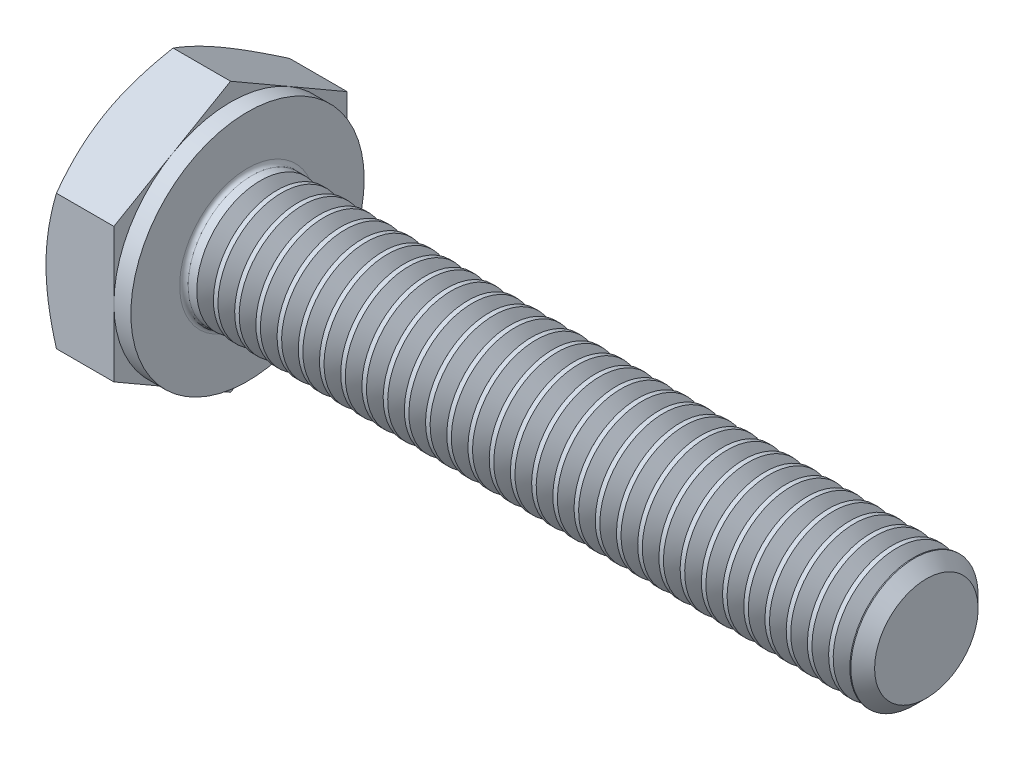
ISO-10303-21;
HEADER;
FILE_DESCRIPTION(('STEP AP214'),'2;1');
FILE_NAME('part.step','',(''),(''),'','','');
FILE_SCHEMA(('AUTOMOTIVE_DESIGN { 1 0 10303 214 1 1 1 1 }'));
ENDSEC;
DATA;
#1=APPLICATION_CONTEXT('core data for automotive mechanical design processes');
#2=APPLICATION_PROTOCOL_DEFINITION('international standard','automotive_design',2000,#1);
#3=PRODUCT_CONTEXT('',#1,'mechanical');
#4=PRODUCT('Part','Part','',(#3));
#5=PRODUCT_RELATED_PRODUCT_CATEGORY('part','',(#4));
#6=PRODUCT_DEFINITION_FORMATION('','',#4);
#7=PRODUCT_DEFINITION_CONTEXT('part definition',#1,'design');
#8=PRODUCT_DEFINITION('design','',#6,#7);
#9=PRODUCT_DEFINITION_SHAPE('','',#8);
#10=(LENGTH_UNIT() NAMED_UNIT(*) SI_UNIT(.MILLI.,.METRE.));
#11=(NAMED_UNIT(*) PLANE_ANGLE_UNIT() SI_UNIT($,.RADIAN.));
#12=(NAMED_UNIT(*) SI_UNIT($,.STERADIAN.) SOLID_ANGLE_UNIT());
#13=UNCERTAINTY_MEASURE_WITH_UNIT(LENGTH_MEASURE(1.E-05),#10,'distance_accuracy_value','');
#14=(GEOMETRIC_REPRESENTATION_CONTEXT(3) GLOBAL_UNCERTAINTY_ASSIGNED_CONTEXT((#13)) GLOBAL_UNIT_ASSIGNED_CONTEXT((#10,
#11,#12)) REPRESENTATION_CONTEXT('',''));
#15=CARTESIAN_POINT('',(0.,0.,0.));
#16=DIRECTION('',(0.,0.,1.));
#17=DIRECTION('',(1.,0.,0.));
#18=AXIS2_PLACEMENT_3D('',#15,#16,#17);
#19=CARTESIAN_POINT('',(2.,3.17542648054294,0.));
#20=DIRECTION('',(1.,0.,0.));
#21=DIRECTION('',(0.,0.,-1.));
#22=AXIS2_PLACEMENT_3D('',#19,#20,#21);
#23=PLANE('',#22);
#24=CARTESIAN_POINT('',(2.,0.,0.));
#25=DIRECTION('',(1.,0.,0.));
#26=DIRECTION('',(0.,0.,-1.));
#27=AXIS2_PLACEMENT_3D('',#24,#25,#26);
#28=CIRCLE('',#27,1.6);
#29=CARTESIAN_POINT('',(2.,0.,-1.6));
#30=VERTEX_POINT('',#29);
#31=EDGE_CURVE('E44',#30,#30,#28,.F.);
#32=ORIENTED_EDGE('',*,*,#31,.T.);
#33=EDGE_LOOP('',(#32));
#34=FACE_BOUND('',#33,.T.);
#35=CARTESIAN_POINT('',(2.,0.,0.));
#36=DIRECTION('',(1.,0.,0.));
#37=DIRECTION('',(0.,0.,-1.));
#38=AXIS2_PLACEMENT_3D('',#35,#36,#37);
#39=CIRCLE('',#38,2.75);
#40=CARTESIAN_POINT('',(2.,0.,-2.75));
#41=VERTEX_POINT('',#40);
#42=EDGE_CURVE('E301',#41,#41,#39,.T.);
#43=ORIENTED_EDGE('',*,*,#42,.T.);
#44=EDGE_LOOP('',(#43));
#45=FACE_BOUND('',#44,.T.);
#46=ADVANCED_FACE('F36',(#34,#45),#23,.T.);
#47=CARTESIAN_POINT('',(0.,0.,0.));
#48=DIRECTION('',(-1.,0.,0.));
#49=DIRECTION('',(0.,0.,1.));
#50=AXIS2_PLACEMENT_3D('',#47,#48,#49);
#51=CYLINDRICAL_SURFACE('',#50,1.5);
#52=CARTESIAN_POINT('',(2.30359178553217,0.,0.));
#53=DIRECTION('',(-1.,0.,0.));
#54=DIRECTION('',(0.,-1.,0.));
#55=AXIS2_PLACEMENT_3D('',#52,#53,#54);
#56=CIRCLE('',#55,1.5);
#57=CARTESIAN_POINT('',(2.30359178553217,-1.5,0.));
#58=VERTEX_POINT('',#57);
#59=EDGE_CURVE('E348',#58,#58,#56,.T.);
#60=ORIENTED_EDGE('',*,*,#59,.T.);
#61=EDGE_LOOP('',(#60));
#62=FACE_BOUND('',#61,.T.);
#63=CARTESIAN_POINT('',(2.1,0.,0.));
#64=DIRECTION('',(1.,0.,0.));
#65=DIRECTION('',(0.,0.,-1.));
#66=AXIS2_PLACEMENT_3D('',#63,#64,#65);
#67=CIRCLE('',#66,1.5);
#68=CARTESIAN_POINT('',(2.1,0.,-1.5));
#69=VERTEX_POINT('',#68);
#70=EDGE_CURVE('E11',#69,#69,#67,.T.);
#71=ORIENTED_EDGE('',*,*,#70,.T.);
#72=EDGE_LOOP('',(#71));
#73=FACE_BOUND('',#72,.T.);
#74=ADVANCED_FACE('F250',(#62,#73),#51,.T.);
#75=CARTESIAN_POINT('',(1.6,2.75,0.));
#76=DIRECTION('',(1.,0.,0.));
#77=DIRECTION('',(0.,0.,-1.));
#78=AXIS2_PLACEMENT_3D('',#75,#76,#77);
#79=PLANE('',#78);
#80=DIRECTION('',(0.,0.500000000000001,0.866025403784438));
#81=VECTOR('',#80,1.);
#82=CARTESIAN_POINT('',(1.6,1.58771324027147,-2.75));
#83=LINE('',#82,#81);
#84=CARTESIAN_POINT('',(1.6,1.58771324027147,-2.75));
#85=VERTEX_POINT('',#84);
#86=CARTESIAN_POINT('',(1.6,2.3815698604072,-1.375));
#87=VERTEX_POINT('',#86);
#88=EDGE_CURVE('E169',#85,#87,#83,.T.);
#89=ORIENTED_EDGE('',*,*,#88,.T.);
#90=CARTESIAN_POINT('',(1.6,0.,0.));
#91=DIRECTION('',(-1.,0.,0.));
#92=DIRECTION('',(0.,0.,1.));
#93=AXIS2_PLACEMENT_3D('',#90,#91,#92);
#94=CIRCLE('',#93,2.75);
#95=CARTESIAN_POINT('',(1.6,0.,-2.75));
#96=VERTEX_POINT('',#95);
#97=EDGE_CURVE('E51',#87,#96,#94,.T.);
#98=ORIENTED_EDGE('',*,*,#97,.T.);
#99=DIRECTION('',(0.,1.,0.));
#100=VECTOR('',#99,1.);
#101=CARTESIAN_POINT('',(1.6,1.58771324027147,-2.75));
#102=LINE('',#101,#100);
#103=EDGE_CURVE('E304',#96,#85,#102,.T.);
#104=ORIENTED_EDGE('',*,*,#103,.T.);
#105=EDGE_LOOP('',(#89,#98,#104));
#106=FACE_BOUND('',#105,.T.);
#107=ADVANCED_FACE('F255',(#106),#79,.T.);
#108=CARTESIAN_POINT('',(1.6,3.17542648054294,0.));
#109=VERTEX_POINT('',#108);
#110=EDGE_CURVE('E167',#87,#109,#83,.T.);
#111=ORIENTED_EDGE('',*,*,#110,.T.);
#112=DIRECTION('',(0.,-0.500000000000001,0.866025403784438));
#113=VECTOR('',#112,1.);
#114=CARTESIAN_POINT('',(1.6,3.17542648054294,0.));
#115=LINE('',#114,#113);
#116=CARTESIAN_POINT('',(1.6,2.3815698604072,1.375));
#117=VERTEX_POINT('',#116);
#118=EDGE_CURVE('E166',#109,#117,#115,.T.);
#119=ORIENTED_EDGE('',*,*,#118,.T.);
#120=EDGE_CURVE('E155',#117,#87,#94,.T.);
#121=ORIENTED_EDGE('',*,*,#120,.T.);
#122=EDGE_LOOP('',(#111,#119,#121));
#123=FACE_BOUND('',#122,.T.);
#124=ADVANCED_FACE('F324',(#123),#79,.T.);
#125=CARTESIAN_POINT('',(1.6,1.58771324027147,2.75));
#126=VERTEX_POINT('',#125);
#127=EDGE_CURVE('E133',#117,#126,#115,.T.);
#128=ORIENTED_EDGE('',*,*,#127,.T.);
#129=DIRECTION('',(0.,-1.,0.));
#130=VECTOR('',#129,1.);
#131=CARTESIAN_POINT('',(1.6,1.58771324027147,2.75));
#132=LINE('',#131,#130);
#133=CARTESIAN_POINT('',(1.6,0.,2.75));
#134=VERTEX_POINT('',#133);
#135=EDGE_CURVE('E127',#126,#134,#132,.T.);
#136=ORIENTED_EDGE('',*,*,#135,.T.);
#137=EDGE_CURVE('E131',#134,#117,#94,.T.);
#138=ORIENTED_EDGE('',*,*,#137,.T.);
#139=EDGE_LOOP('',(#128,#136,#138));
#140=FACE_BOUND('',#139,.T.);
#141=ADVANCED_FACE('F129',(#140),#79,.T.);
#142=CARTESIAN_POINT('',(1.6,-1.58771324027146,2.75));
#143=VERTEX_POINT('',#142);
#144=EDGE_CURVE('E137',#134,#143,#132,.T.);
#145=ORIENTED_EDGE('',*,*,#144,.T.);
#146=DIRECTION('',(0.,-0.500000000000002,-0.866025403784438));
#147=VECTOR('',#146,1.);
#148=CARTESIAN_POINT('',(1.6,-3.17542648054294,0.));
#149=LINE('',#148,#147);
#150=CARTESIAN_POINT('',(1.6,-2.3815698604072,1.375));
#151=VERTEX_POINT('',#150);
#152=EDGE_CURVE('E144',#143,#151,#149,.T.);
#153=ORIENTED_EDGE('',*,*,#152,.T.);
#154=EDGE_CURVE('E141',#151,#134,#94,.T.);
#155=ORIENTED_EDGE('',*,*,#154,.T.);
#156=EDGE_LOOP('',(#145,#153,#155));
#157=FACE_BOUND('',#156,.T.);
#158=ADVANCED_FACE('F142',(#157),#79,.T.);
#159=CARTESIAN_POINT('',(1.6,-3.17542648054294,0.));
#160=VERTEX_POINT('',#159);
#161=EDGE_CURVE('E161',#151,#160,#149,.T.);
#162=ORIENTED_EDGE('',*,*,#161,.T.);
#163=DIRECTION('',(0.,0.5,-0.866025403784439));
#164=VECTOR('',#163,1.);
#165=CARTESIAN_POINT('',(1.6,-1.58771324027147,-2.75));
#166=LINE('',#165,#164);
#167=CARTESIAN_POINT('',(1.6,-2.38156986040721,-1.375));
#168=VERTEX_POINT('',#167);
#169=EDGE_CURVE('E344',#160,#168,#166,.T.);
#170=ORIENTED_EDGE('',*,*,#169,.T.);
#171=EDGE_CURVE('E148',#168,#151,#94,.T.);
#172=ORIENTED_EDGE('',*,*,#171,.T.);
#173=EDGE_LOOP('',(#162,#170,#172));
#174=FACE_BOUND('',#173,.T.);
#175=ADVANCED_FACE('F1067',(#174),#79,.T.);
#176=CARTESIAN_POINT('',(1.6,-1.58771324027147,-2.75));
#177=VERTEX_POINT('',#176);
#178=EDGE_CURVE('E156',#168,#177,#166,.T.);
#179=ORIENTED_EDGE('',*,*,#178,.T.);
#180=EDGE_CURVE('E305',#177,#96,#102,.T.);
#181=ORIENTED_EDGE('',*,*,#180,.T.);
#182=EDGE_CURVE('E313',#96,#168,#94,.T.);
#183=ORIENTED_EDGE('',*,*,#182,.T.);
#184=EDGE_LOOP('',(#179,#181,#183));
#185=FACE_BOUND('',#184,.T.);
#186=ADVANCED_FACE('F312',(#185),#79,.T.);
#187=CARTESIAN_POINT('',(0.,0.,0.));
#188=DIRECTION('',(-1.,0.,0.));
#189=DIRECTION('',(0.,0.,1.));
#190=AXIS2_PLACEMENT_3D('',#187,#188,#189);
#191=CYLINDRICAL_SURFACE('',#190,2.75);
#192=ORIENTED_EDGE('',*,*,#97,.F.);
#193=ORIENTED_EDGE('',*,*,#120,.F.);
#194=ORIENTED_EDGE('',*,*,#137,.F.);
#195=ORIENTED_EDGE('',*,*,#154,.F.);
#196=ORIENTED_EDGE('',*,*,#171,.F.);
#197=ORIENTED_EDGE('',*,*,#182,.F.);
#198=EDGE_LOOP('',(#192,#193,#194,#195,#196,#197));
#199=FACE_BOUND('',#198,.T.);
#200=ORIENTED_EDGE('',*,*,#42,.F.);
#201=EDGE_LOOP('',(#200));
#202=FACE_BOUND('',#201,.T.);
#203=ADVANCED_FACE('F152',(#199,#202),#191,.T.);
#204=CARTESIAN_POINT('',(0.,3.17542648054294,0.));
#205=DIRECTION('',(1.,0.,0.));
#206=DIRECTION('',(0.,0.,-1.));
#207=AXIS2_PLACEMENT_3D('',#204,#205,#206);
#208=PLANE('',#207);
#209=CARTESIAN_POINT('',(0.,0.,0.));
#210=DIRECTION('',(1.,0.,0.));
#211=DIRECTION('',(0.,0.,-1.));
#212=AXIS2_PLACEMENT_3D('',#209,#210,#211);
#213=CIRCLE('',#212,2.75);
#214=CARTESIAN_POINT('',(0.,0.,-2.75));
#215=VERTEX_POINT('',#214);
#216=CARTESIAN_POINT('',(0.,2.3815698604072,-1.375));
#217=VERTEX_POINT('',#216);
#218=EDGE_CURVE('E300',#215,#217,#213,.T.);
#219=ORIENTED_EDGE('',*,*,#218,.F.);
#220=CARTESIAN_POINT('',(0.,-2.38156986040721,-1.375));
#221=VERTEX_POINT('',#220);
#222=EDGE_CURVE('E296',#221,#215,#213,.T.);
#223=ORIENTED_EDGE('',*,*,#222,.F.);
#224=CARTESIAN_POINT('',(0.,-2.3815698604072,1.375));
#225=VERTEX_POINT('',#224);
#226=EDGE_CURVE('E299',#225,#221,#213,.T.);
#227=ORIENTED_EDGE('',*,*,#226,.F.);
#228=CARTESIAN_POINT('',(0.,0.,2.75));
#229=VERTEX_POINT('',#228);
#230=EDGE_CURVE('E337',#229,#225,#213,.T.);
#231=ORIENTED_EDGE('',*,*,#230,.F.);
#232=CARTESIAN_POINT('',(0.,0.,0.));
#233=DIRECTION('',(-1.,0.,0.));
#234=DIRECTION('',(0.,0.,1.));
#235=AXIS2_PLACEMENT_3D('',#232,#233,#234);
#236=CIRCLE('',#235,2.75);
#237=CARTESIAN_POINT('',(0.,2.3815698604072,1.375));
#238=VERTEX_POINT('',#237);
#239=EDGE_CURVE('E170',#229,#238,#236,.T.);
#240=ORIENTED_EDGE('',*,*,#239,.T.);
#241=EDGE_CURVE('E1736',#217,#238,#213,.T.);
#242=ORIENTED_EDGE('',*,*,#241,.F.);
#243=EDGE_LOOP('',(#219,#223,#227,#231,#240,#242));
#244=FACE_BOUND('',#243,.T.);
#245=ADVANCED_FACE('F199',(#244),#208,.F.);
#246=CARTESIAN_POINT('',(0.,0.,0.));
#247=DIRECTION('',(1.,0.,0.));
#248=DIRECTION('',(0.,0.,-1.));
#249=AXIS2_PLACEMENT_3D('',#246,#247,#248);
#250=CONICAL_SURFACE('',#249,2.75,1.0471975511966);
#251=CARTESIAN_POINT('',(0.245686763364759,1.58759777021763,2.7502));
#252=CARTESIAN_POINT('',(0.205387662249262,1.65737010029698,2.62935077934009));
#253=CARTESIAN_POINT('',(0.168736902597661,1.72774469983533,2.50745839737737));
#254=CARTESIAN_POINT('',(0.1047621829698,1.86971254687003,2.26156287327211));
#255=CARTESIAN_POINT('',(0.0774608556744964,1.94130831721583,2.13755536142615));
#256=CARTESIAN_POINT('',(0.034961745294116,2.08361254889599,1.89107720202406));
#257=CARTESIAN_POINT('',(0.0194811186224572,2.15429911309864,1.76864448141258));
#258=CARTESIAN_POINT('',(0.000999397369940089,2.29600490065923,1.52320285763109));
#259=CARTESIAN_POINT('',(-0.00201700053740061,2.36702360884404,1.40019484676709));
#260=CARTESIAN_POINT('',(0.00425314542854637,2.49972966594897,1.17034121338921));
#261=CARTESIAN_POINT('',(0.012000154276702,2.56143686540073,1.06346120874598));
#262=CARTESIAN_POINT('',(0.0365551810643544,2.68444923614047,0.850397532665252));
#263=CARTESIAN_POINT('',(0.05337158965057,2.74575398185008,0.744214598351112));
#264=CARTESIAN_POINT('',(0.0954119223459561,2.86902004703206,0.530711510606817));
#265=CARTESIAN_POINT('',(0.120814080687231,2.93096576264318,0.423418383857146));
#266=CARTESIAN_POINT('',(0.178467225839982,3.05393320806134,0.210432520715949));
#267=CARTESIAN_POINT('',(0.210704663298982,3.11495651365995,0.104737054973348));
#268=CARTESIAN_POINT('',(0.24568676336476,3.17554195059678,-0.000199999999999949));
#269=B_SPLINE_CURVE_WITH_KNOTS('',3,(#251,#252,#253,#254,#255,#256,#257,#258,#259,#260,#261,
#262,#263,#264,#265,#266,#267,#268),.UNSPECIFIED.,.F.,.F.,(4,2,2,2,2,2,2,2,4),(0.,
0.435912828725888,0.872873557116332,1.29901931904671,1.72464171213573,2.09526089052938,
2.46622354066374,2.84541551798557,3.22386274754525),.UNSPECIFIED.);
#270=CARTESIAN_POINT('',(0.245620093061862,3.17542648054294,0.));
#271=VERTEX_POINT('',#270);
#272=EDGE_CURVE('E218',#238,#271,#269,.T.);
#273=ORIENTED_EDGE('',*,*,#272,.T.);
#274=CARTESIAN_POINT('',(0.24568676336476,3.17554195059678,0.0002));
#275=CARTESIAN_POINT('',(0.205387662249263,3.10576962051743,-0.120649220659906));
#276=CARTESIAN_POINT('',(0.168736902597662,3.03539502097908,-0.242541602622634));
#277=CARTESIAN_POINT('',(0.1047621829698,2.89342717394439,-0.488437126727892));
#278=CARTESIAN_POINT('',(0.077460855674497,2.82183140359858,-0.612444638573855));
#279=CARTESIAN_POINT('',(0.0349617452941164,2.67952717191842,-0.858922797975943));
#280=CARTESIAN_POINT('',(0.0194811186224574,2.60884060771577,-0.981355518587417));
#281=CARTESIAN_POINT('',(0.000999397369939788,2.46713482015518,-1.22679714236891));
#282=CARTESIAN_POINT('',(-0.00201700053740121,2.39611611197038,-1.34980515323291));
#283=CARTESIAN_POINT('',(0.00425314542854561,2.26341005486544,-1.57965878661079));
#284=CARTESIAN_POINT('',(0.0120001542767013,2.20170285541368,-1.68653879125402));
#285=CARTESIAN_POINT('',(0.0365551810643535,2.07869048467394,-1.89960246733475));
#286=CARTESIAN_POINT('',(0.0533715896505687,2.01738573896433,-2.00578540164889));
#287=CARTESIAN_POINT('',(0.0954119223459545,1.89411967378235,-2.21928848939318));
#288=CARTESIAN_POINT('',(0.120814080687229,1.83217395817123,-2.32658161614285));
#289=CARTESIAN_POINT('',(0.17846722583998,1.70920651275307,-2.53956747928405));
#290=CARTESIAN_POINT('',(0.21070466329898,1.64818320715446,-2.64526294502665));
#291=CARTESIAN_POINT('',(0.245686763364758,1.58759777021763,-2.7502));
#292=B_SPLINE_CURVE_WITH_KNOTS('',3,(#274,#275,#276,#277,#278,#279,#280,#281,#282,#283,#284,
#285,#286,#287,#288,#289,#290,#291),.UNSPECIFIED.,.F.,.F.,(4,2,2,2,2,2,2,2,4),(0.,
0.435912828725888,0.872873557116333,1.29901931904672,1.72464171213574,2.09526089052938,
2.46622354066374,2.84541551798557,3.22386274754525),.UNSPECIFIED.);
#293=EDGE_CURVE('E59',#271,#217,#292,.T.);
#294=ORIENTED_EDGE('',*,*,#293,.T.);
#295=ORIENTED_EDGE('',*,*,#241,.T.);
#296=EDGE_LOOP('',(#273,#294,#295));
#297=FACE_BOUND('',#296,.T.);
#298=ADVANCED_FACE('F1097',(#297),#250,.T.);
#299=CARTESIAN_POINT('',(1.36715210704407,-4.31638594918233,2.75));
#300=CARTESIAN_POINT('',(1.30845994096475,-4.19581737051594,2.75));
#301=CARTESIAN_POINT('',(1.25031586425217,-4.07497746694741,2.75));
#302=CARTESIAN_POINT('',(1.1354311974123,-3.83261088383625,2.75));
#303=CARTESIAN_POINT('',(1.07869081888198,-3.71108410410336,2.75));
#304=CARTESIAN_POINT('',(0.966646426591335,-3.46659808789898,2.75));
#305=CARTESIAN_POINT('',(0.91135147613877,-3.34363468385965,2.75));
#306=CARTESIAN_POINT('',(0.802956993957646,-3.09674757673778,2.75));
#307=CARTESIAN_POINT('',(0.749857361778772,-2.97282391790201,2.75));
#308=CARTESIAN_POINT('',(0.644703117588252,-2.71965806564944,2.75));
#309=CARTESIAN_POINT('',(0.59274272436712,-2.59037652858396,2.75));
#310=CARTESIAN_POINT('',(0.492631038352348,-2.33032018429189,2.75));
#311=CARTESIAN_POINT('',(0.444480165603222,-2.19954521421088,2.75));
#312=CARTESIAN_POINT('',(0.353213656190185,-1.9365223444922,2.75));
#313=CARTESIAN_POINT('',(0.310088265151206,-1.80427786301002,2.75));
#314=CARTESIAN_POINT('',(0.230222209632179,-1.53789259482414,2.75));
#315=CARTESIAN_POINT('',(0.193479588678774,-1.40375240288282,2.75));
#316=CARTESIAN_POINT('',(0.12830206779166,-1.13423793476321,2.75));
#317=CARTESIAN_POINT('',(0.0998212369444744,-0.998874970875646,2.75));
#318=CARTESIAN_POINT('',(0.0527456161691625,-0.726413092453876,2.75));
#319=CARTESIAN_POINT('',(0.0341497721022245,-0.589314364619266,2.75));
#320=CARTESIAN_POINT('',(0.00856858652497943,-0.315877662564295,2.75));
#321=CARTESIAN_POINT('',(0.00142992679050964,-0.179554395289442,2.75));
#322=CARTESIAN_POINT('',(-0.00103867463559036,0.0932131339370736,2.75));
#323=CARTESIAN_POINT('',(0.00363158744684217,0.229657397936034,2.75));
#324=CARTESIAN_POINT('',(0.0211304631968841,0.459764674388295,2.75));
#325=CARTESIAN_POINT('',(0.0310050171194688,0.553667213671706,2.75));
#326=CARTESIAN_POINT('',(0.0557601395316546,0.740814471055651,2.75));
#327=CARTESIAN_POINT('',(0.0706413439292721,0.834059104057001,2.75));
#328=CARTESIAN_POINT('',(0.122015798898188,1.1126628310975,2.75));
#329=CARTESIAN_POINT('',(0.165231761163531,1.29679769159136,2.75));
#330=CARTESIAN_POINT('',(0.240559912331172,1.57226006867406,2.75));
#331=CARTESIAN_POINT('',(0.267790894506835,1.66500394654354,2.75));
#332=CARTESIAN_POINT('',(0.325176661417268,1.84959145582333,2.75));
#333=CARTESIAN_POINT('',(0.35533146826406,1.94143508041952,2.75));
#334=CARTESIAN_POINT('',(0.418073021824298,2.12425036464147,2.75));
#335=CARTESIAN_POINT('',(0.450659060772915,2.21522226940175,2.75));
#336=CARTESIAN_POINT('',(0.517870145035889,2.39640501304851,2.75));
#337=CARTESIAN_POINT('',(0.552495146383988,2.48661586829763,2.75));
#338=CARTESIAN_POINT('',(0.647111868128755,2.72631941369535,2.75));
#339=CARTESIAN_POINT('',(0.708617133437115,2.87521406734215,2.75));
#340=CARTESIAN_POINT('',(0.835163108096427,3.17149877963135,2.75));
#341=CARTESIAN_POINT('',(0.900204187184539,3.31888867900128,2.75));
#342=CARTESIAN_POINT('',(1.03299372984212,3.61249860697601,2.75));
#343=CARTESIAN_POINT('',(1.1007430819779,3.75871823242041,2.75));
#344=CARTESIAN_POINT('',(1.23832197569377,4.05017738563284,2.75));
#345=CARTESIAN_POINT('',(1.30815157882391,4.19541688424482,2.75));
#346=CARTESIAN_POINT('',(1.52027220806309,4.6303907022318,2.75));
#347=CARTESIAN_POINT('',(1.66499194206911,4.91893915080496,2.75));
#348=CARTESIAN_POINT('',(1.95851426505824,5.49386340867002,2.75));
#349=CARTESIAN_POINT('',(2.10731603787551,5.78023963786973,2.75));
#350=CARTESIAN_POINT('',(2.39216757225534,6.32194576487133,2.75));
#351=CARTESIAN_POINT('',(2.52794261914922,6.57742037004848,2.75));
#352=CARTESIAN_POINT('',(2.80114245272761,7.08750371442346,2.75));
#353=CARTESIAN_POINT('',(2.93856733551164,7.34211240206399,2.75));
#354=CARTESIAN_POINT('',(3.21419429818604,7.84983547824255,2.75));
#355=CARTESIAN_POINT('',(3.35239239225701,8.10295203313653,2.75));
#356=CARTESIAN_POINT('',(3.62973059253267,8.60864374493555,2.75));
#357=CARTESIAN_POINT('',(3.76887062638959,8.86121894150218,2.75));
#358=CARTESIAN_POINT('',(3.90835389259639,9.11360311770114,2.75));
#359=B_SPLINE_CURVE_WITH_KNOTS('',3,(#299,#300,#301,#302,#303,#304,#305,#306,#307,#308,#309,
#310,#311,#312,#313,#314,#315,#316,#317,#318,#319,#320,#321,#322,#323,#324,#325,#326,#327,#328,
#329,#330,#331,#332,#333,#334,#335,#336,#337,#338,#339,#340,#341,#342,#343,#344,#345,#346,#347,
#348,#349,#350,#351,#352,#353,#354,#355,#356,#357,#358),.UNSPECIFIED.,.F.,.F.,(4,2,2,2,2,2,2,2,
2,2,2,2,2,2,2,2,2,2,2,2,2,2,2,2,2,2,2,2,2,4),(0.,0.40229060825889,0.804641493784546,
1.20909649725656,1.61353297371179,2.03148461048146,2.44948226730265,2.86665458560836,
3.28369880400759,3.69837799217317,4.11301294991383,4.52205162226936,4.9310973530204,
5.21422195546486,5.49738253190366,6.06398562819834,6.35393648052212,6.64388952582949,
6.933758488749,7.2236212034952,7.70684704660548,8.19012351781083,8.67355987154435,
9.15701054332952,10.1253686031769,11.0935344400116,11.9614658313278,12.8294480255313,
13.6946049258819,14.5596961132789),.UNSPECIFIED.);
#360=CARTESIAN_POINT('',(0.245620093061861,1.58771324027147,2.75));
#361=VERTEX_POINT('',#360);
#362=EDGE_CURVE('E230',#229,#361,#359,.T.);
#363=ORIENTED_EDGE('',*,*,#362,.T.);
#364=EDGE_CURVE('E229',#361,#238,#269,.T.);
#365=ORIENTED_EDGE('',*,*,#364,.T.);
#366=ORIENTED_EDGE('',*,*,#239,.F.);
#367=EDGE_LOOP('',(#363,#365,#366));
#368=FACE_BOUND('',#367,.T.);
#369=ADVANCED_FACE('F331',(#368),#250,.T.);
#370=CARTESIAN_POINT('',(0.245620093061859,-1.58771324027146,2.75));
#371=VERTEX_POINT('',#370);
#372=EDGE_CURVE('E281',#371,#229,#359,.T.);
#373=ORIENTED_EDGE('',*,*,#372,.T.);
#374=ORIENTED_EDGE('',*,*,#230,.T.);
#375=CARTESIAN_POINT('',(0.24568676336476,-3.17554195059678,-0.000200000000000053));
#376=CARTESIAN_POINT('',(0.205387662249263,-3.10576962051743,0.120649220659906));
#377=CARTESIAN_POINT('',(0.168736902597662,-3.03539502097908,0.242541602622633));
#378=CARTESIAN_POINT('',(0.104762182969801,-2.89342717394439,0.488437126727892));
#379=CARTESIAN_POINT('',(0.0774608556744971,-2.82183140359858,0.612444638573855));
#380=CARTESIAN_POINT('',(0.0349617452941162,-2.67952717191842,0.858922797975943));
#381=CARTESIAN_POINT('',(0.0194811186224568,-2.60884060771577,0.981355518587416));
#382=CARTESIAN_POINT('',(0.00099939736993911,-2.46713482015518,1.22679714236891));
#383=CARTESIAN_POINT('',(-0.00201700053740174,-2.39611611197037,1.34980515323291));
#384=CARTESIAN_POINT('',(0.00425314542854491,-2.26341005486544,1.57965878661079));
#385=CARTESIAN_POINT('',(0.0120001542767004,-2.20170285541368,1.68653879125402));
#386=CARTESIAN_POINT('',(0.0365551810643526,-2.07869048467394,1.89960246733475));
#387=CARTESIAN_POINT('',(0.053371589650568,-2.01738573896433,2.00578540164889));
#388=CARTESIAN_POINT('',(0.0954119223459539,-1.89411967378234,2.21928848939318));
#389=CARTESIAN_POINT('',(0.120814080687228,-1.83217395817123,2.32658161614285));
#390=CARTESIAN_POINT('',(0.178467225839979,-1.70920651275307,2.53956747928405));
#391=CARTESIAN_POINT('',(0.210704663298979,-1.64818320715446,2.64526294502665));
#392=CARTESIAN_POINT('',(0.245686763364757,-1.58759777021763,2.7502));
#393=B_SPLINE_CURVE_WITH_KNOTS('',3,(#375,#376,#377,#378,#379,#380,#381,#382,#383,#384,#385,
#386,#387,#388,#389,#390,#391,#392),.UNSPECIFIED.,.F.,.F.,(4,2,2,2,2,2,2,2,4),(0.,
0.435912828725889,0.872873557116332,1.29901931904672,1.72464171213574,2.09526089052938,
2.46622354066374,2.84541551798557,3.22386274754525),.UNSPECIFIED.);
#394=EDGE_CURVE('E220',#225,#371,#393,.T.);
#395=ORIENTED_EDGE('',*,*,#394,.T.);
#396=EDGE_LOOP('',(#373,#374,#395));
#397=FACE_BOUND('',#396,.T.);
#398=ADVANCED_FACE('F188',(#397),#250,.T.);
#399=CARTESIAN_POINT('',(0.245620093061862,-3.17542648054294,0.));
#400=VERTEX_POINT('',#399);
#401=EDGE_CURVE('E213',#400,#225,#393,.T.);
#402=ORIENTED_EDGE('',*,*,#401,.T.);
#403=ORIENTED_EDGE('',*,*,#226,.T.);
#404=CARTESIAN_POINT('',(0.24568676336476,-1.58759777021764,-2.7502));
#405=CARTESIAN_POINT('',(0.205387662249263,-1.65737010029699,-2.62935077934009));
#406=CARTESIAN_POINT('',(0.168736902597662,-1.72774469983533,-2.50745839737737));
#407=CARTESIAN_POINT('',(0.104762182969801,-1.86971254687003,-2.26156287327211));
#408=CARTESIAN_POINT('',(0.077460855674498,-1.94130831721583,-2.13755536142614));
#409=CARTESIAN_POINT('',(0.0349617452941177,-2.08361254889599,-1.89107720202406));
#410=CARTESIAN_POINT('',(0.0194811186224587,-2.15429911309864,-1.76864448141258));
#411=CARTESIAN_POINT('',(0.000999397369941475,-2.29600490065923,-1.52320285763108));
#412=CARTESIAN_POINT('',(-0.00201700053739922,-2.36702360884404,-1.40019484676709));
#413=CARTESIAN_POINT('',(0.00425314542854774,-2.49972966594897,-1.17034121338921));
#414=CARTESIAN_POINT('',(0.0120001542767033,-2.56143686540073,-1.06346120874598));
#415=CARTESIAN_POINT('',(0.0365551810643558,-2.68444923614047,-0.85039753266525));
#416=CARTESIAN_POINT('',(0.0533715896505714,-2.74575398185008,-0.74421459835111));
#417=CARTESIAN_POINT('',(0.0954119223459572,-2.86902004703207,-0.530711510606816));
#418=CARTESIAN_POINT('',(0.120814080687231,-2.93096576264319,-0.423418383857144));
#419=CARTESIAN_POINT('',(0.178467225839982,-3.05393320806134,-0.210432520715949));
#420=CARTESIAN_POINT('',(0.210704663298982,-3.11495651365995,-0.104737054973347));
#421=CARTESIAN_POINT('',(0.24568676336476,-3.17554195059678,0.000200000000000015));
#422=B_SPLINE_CURVE_WITH_KNOTS('',3,(#404,#405,#406,#407,#408,#409,#410,#411,#412,#413,#414,
#415,#416,#417,#418,#419,#420,#421),.UNSPECIFIED.,.F.,.F.,(4,2,2,2,2,2,2,2,4),(0.,
0.435912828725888,0.872873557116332,1.29901931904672,1.72464171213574,2.09526089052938,
2.46622354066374,2.84541551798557,3.22386274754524),.UNSPECIFIED.);
#423=EDGE_CURVE('E219',#221,#400,#422,.T.);
#424=ORIENTED_EDGE('',*,*,#423,.T.);
#425=EDGE_LOOP('',(#402,#403,#424));
#426=FACE_BOUND('',#425,.T.);
#427=ADVANCED_FACE('F1110',(#426),#250,.T.);
#428=CARTESIAN_POINT('',(0.24562009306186,1.58771324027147,-2.75));
#429=VERTEX_POINT('',#428);
#430=EDGE_CURVE('E221',#217,#429,#292,.T.);
#431=ORIENTED_EDGE('',*,*,#430,.T.);
#432=CARTESIAN_POINT('',(1.3671521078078,-4.31638595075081,-2.75));
#433=CARTESIAN_POINT('',(1.30845994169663,-4.19581737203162,-2.75));
#434=CARTESIAN_POINT('',(1.25031586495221,-4.07497746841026,-2.75));
#435=CARTESIAN_POINT('',(1.13543119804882,-3.83261088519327,-2.75));
#436=CARTESIAN_POINT('',(1.07869081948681,-3.7110841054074,-2.75));
#437=CARTESIAN_POINT('',(0.966646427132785,-3.46659808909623,-2.75));
#438=CARTESIAN_POINT('',(0.911351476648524,-3.3436346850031,-2.75));
#439=CARTESIAN_POINT('',(0.802956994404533,-3.09674757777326,-2.75));
#440=CARTESIAN_POINT('',(0.749857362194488,-2.97282391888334,-2.75));
#441=CARTESIAN_POINT('',(0.644703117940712,-2.71965806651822,-2.75));
#442=CARTESIAN_POINT('',(0.592742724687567,-2.59037652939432,-2.75));
#443=CARTESIAN_POINT('',(0.492631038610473,-2.33032018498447,-2.75));
#444=CARTESIAN_POINT('',(0.444480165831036,-2.19954521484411,-2.75));
#445=CARTESIAN_POINT('',(0.353213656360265,-1.93652234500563,-2.75));
#446=CARTESIAN_POINT('',(0.310088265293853,-1.80427786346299,-2.75));
#447=CARTESIAN_POINT('',(0.230222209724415,-1.53789259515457,-2.75));
#448=CARTESIAN_POINT('',(0.193479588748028,-1.40375240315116,-2.75));
#449=CARTESIAN_POINT('',(0.128302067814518,-1.13423793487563,-2.75));
#450=CARTESIAN_POINT('',(0.0998212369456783,-0.998874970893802,-2.75));
#451=CARTESIAN_POINT('',(0.05274561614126,-0.726413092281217,-2.75));
#452=CARTESIAN_POINT('',(0.0341497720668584,-0.589314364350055,-2.75));
#453=CARTESIAN_POINT('',(0.00856858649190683,-0.315877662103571,-2.75));
#454=CARTESIAN_POINT('',(0.00142992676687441,-0.179554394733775,-2.75));
#455=CARTESIAN_POINT('',(-0.00103867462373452,0.0932131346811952,-2.75));
#456=CARTESIAN_POINT('',(0.00363158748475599,0.229657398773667,-2.75));
#457=CARTESIAN_POINT('',(0.0211304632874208,0.45976467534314,-2.75));
#458=CARTESIAN_POINT('',(0.0310050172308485,0.553667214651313,-2.75));
#459=CARTESIAN_POINT('',(0.0557601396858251,0.740814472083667,-2.75));
#460=CARTESIAN_POINT('',(0.0706413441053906,0.834059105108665,-2.75));
#461=CARTESIAN_POINT('',(0.122015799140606,1.1126628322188,-2.75));
#462=CARTESIAN_POINT('',(0.16523176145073,1.29679769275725,-2.75));
#463=CARTESIAN_POINT('',(0.240559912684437,1.57226006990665,-2.75));
#464=CARTESIAN_POINT('',(0.267790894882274,1.66500394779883,-2.75));
#465=CARTESIAN_POINT('',(0.325176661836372,1.84959145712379,-2.75));
#466=CARTESIAN_POINT('',(0.355331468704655,1.94143508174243,-2.75));
#467=CARTESIAN_POINT('',(0.4180730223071,2.12425036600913,-2.75));
#468=CARTESIAN_POINT('',(0.450659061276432,2.21522227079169,-2.75));
#469=CARTESIAN_POINT('',(0.51787014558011,2.39640501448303,-2.75));
#470=CARTESIAN_POINT('',(0.552495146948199,2.48661586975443,-2.75));
#471=CARTESIAN_POINT('',(0.647111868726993,2.72631941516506,-2.75));
#472=CARTESIAN_POINT('',(0.708617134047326,2.87521406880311,-2.75));
#473=CARTESIAN_POINT('',(0.835163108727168,3.17149878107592,-2.75));
#474=CARTESIAN_POINT('',(0.900204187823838,3.31888868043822,-2.75));
#475=CARTESIAN_POINT('',(1.03299373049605,3.61249860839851,-2.75));
#476=CARTESIAN_POINT('',(1.10074308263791,3.7587182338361,-2.75));
#477=CARTESIAN_POINT('',(1.23832197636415,4.05017738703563,-2.75));
#478=CARTESIAN_POINT('',(1.30815157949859,4.19541688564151,-2.75));
#479=CARTESIAN_POINT('',(1.52027220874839,4.63039070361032,-2.75));
#480=CARTESIAN_POINT('',(1.6649919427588,4.91893915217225,-2.75));
#481=CARTESIAN_POINT('',(1.95851426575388,5.49386341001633,-2.75));
#482=CARTESIAN_POINT('',(2.10731603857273,5.78023963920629,-2.75));
#483=CARTESIAN_POINT('',(2.39216757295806,6.32194576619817,-2.75));
#484=CARTESIAN_POINT('',(2.52794261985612,6.57742037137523,-2.75));
#485=CARTESIAN_POINT('',(2.80114245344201,7.08750371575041,-2.75));
#486=CARTESIAN_POINT('',(2.93856733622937,7.34211240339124,-2.75));
#487=CARTESIAN_POINT('',(3.21419429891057,7.84983547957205,-2.75));
#488=CARTESIAN_POINT('',(3.35239239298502,8.10295203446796,-2.75));
#489=CARTESIAN_POINT('',(3.62973059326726,8.6086437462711,-2.75));
#490=CARTESIAN_POINT('',(3.76887062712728,8.86121894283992,-2.75));
#491=CARTESIAN_POINT('',(3.90835389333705,9.11360311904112,-2.75));
#492=B_SPLINE_CURVE_WITH_KNOTS('',3,(#432,#433,#434,#435,#436,#437,#438,#439,#440,#441,#442,
#443,#444,#445,#446,#447,#448,#449,#450,#451,#452,#453,#454,#455,#456,#457,#458,#459,#460,#461,
#462,#463,#464,#465,#466,#467,#468,#469,#470,#471,#472,#473,#474,#475,#476,#477,#478,#479,#480,
#481,#482,#483,#484,#485,#486,#487,#488,#489,#490,#491),.UNSPECIFIED.,.F.,.F.,(4,2,2,2,2,2,2,2,
2,2,2,2,2,2,2,2,2,2,2,2,2,2,2,2,2,2,2,2,2,4),(0.,0.402290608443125,0.804641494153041,
1.20909649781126,1.61353297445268,2.03148461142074,2.44948226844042,2.86665458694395,
3.28369880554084,3.69837799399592,4.11301295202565,4.52205162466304,4.93109735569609,
5.21422195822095,5.49738253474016,6.06398563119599,6.35393648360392,6.64388952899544,
6.93375849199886,7.22362120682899,7.70684704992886,8.19012352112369,8.67355987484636,
9.15701054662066,10.1253686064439,11.0935344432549,11.9614658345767,12.8294480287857,
13.6946049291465,14.5596961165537),.UNSPECIFIED.);
#493=EDGE_CURVE('E181',#429,#215,#492,.F.);
#494=ORIENTED_EDGE('',*,*,#493,.T.);
#495=ORIENTED_EDGE('',*,*,#218,.T.);
#496=EDGE_LOOP('',(#431,#494,#495));
#497=FACE_BOUND('',#496,.T.);
#498=ADVANCED_FACE('F1105',(#497),#250,.T.);
#499=CARTESIAN_POINT('',(0.245620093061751,-1.58771324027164,-2.75));
#500=VERTEX_POINT('',#499);
#501=EDGE_CURVE('E182',#500,#221,#422,.T.);
#502=ORIENTED_EDGE('',*,*,#501,.T.);
#503=ORIENTED_EDGE('',*,*,#222,.T.);
#504=EDGE_CURVE('E173',#215,#500,#492,.F.);
#505=ORIENTED_EDGE('',*,*,#504,.T.);
#506=EDGE_LOOP('',(#502,#503,#505));
#507=FACE_BOUND('',#506,.T.);
#508=ADVANCED_FACE('F197',(#507),#250,.T.);
#509=CARTESIAN_POINT('',(2.,1.58771324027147,-2.75));
#510=DIRECTION('',(0.,0.,1.));
#511=DIRECTION('',(0.,-1.,0.));
#512=AXIS2_PLACEMENT_3D('',#509,#510,#511);
#513=PLANE('',#512);
#514=ORIENTED_EDGE('',*,*,#180,.F.);
#515=DIRECTION('',(-1.,0.,0.));
#516=VECTOR('',#515,1.);
#517=CARTESIAN_POINT('',(2.,-1.58771324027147,-2.75));
#518=LINE('',#517,#516);
#519=EDGE_CURVE('E287',#177,#500,#518,.T.);
#520=ORIENTED_EDGE('',*,*,#519,.T.);
#521=ORIENTED_EDGE('',*,*,#504,.F.);
#522=ORIENTED_EDGE('',*,*,#493,.F.);
#523=DIRECTION('',(-1.,0.,0.));
#524=VECTOR('',#523,1.);
#525=CARTESIAN_POINT('',(2.,1.58771324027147,-2.75));
#526=LINE('',#525,#524);
#527=EDGE_CURVE('E283',#85,#429,#526,.T.);
#528=ORIENTED_EDGE('',*,*,#527,.F.);
#529=ORIENTED_EDGE('',*,*,#103,.F.);
#530=EDGE_LOOP('',(#514,#520,#521,#522,#528,#529));
#531=FACE_BOUND('',#530,.T.);
#532=ADVANCED_FACE('F192',(#531),#513,.F.);
#533=CARTESIAN_POINT('',(2.,-1.58771324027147,-2.75));
#534=DIRECTION('',(0.,0.866025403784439,0.5));
#535=DIRECTION('',(0.,-0.5,0.866025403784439));
#536=AXIS2_PLACEMENT_3D('',#533,#534,#535);
#537=PLANE('',#536);
#538=ORIENTED_EDGE('',*,*,#169,.F.);
#539=DIRECTION('',(-1.,0.,0.));
#540=VECTOR('',#539,1.);
#541=CARTESIAN_POINT('',(2.,-3.17542648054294,0.));
#542=LINE('',#541,#540);
#543=EDGE_CURVE('E289',#160,#400,#542,.T.);
#544=ORIENTED_EDGE('',*,*,#543,.T.);
#545=ORIENTED_EDGE('',*,*,#423,.F.);
#546=ORIENTED_EDGE('',*,*,#501,.F.);
#547=ORIENTED_EDGE('',*,*,#519,.F.);
#548=ORIENTED_EDGE('',*,*,#178,.F.);
#549=EDGE_LOOP('',(#538,#544,#545,#546,#547,#548));
#550=FACE_BOUND('',#549,.T.);
#551=ADVANCED_FACE('F196',(#550),#537,.F.);
#552=CARTESIAN_POINT('',(2.,-3.17542648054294,0.));
#553=DIRECTION('',(0.,0.866025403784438,-0.500000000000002));
#554=DIRECTION('',(0.,0.500000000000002,0.866025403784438));
#555=AXIS2_PLACEMENT_3D('',#552,#553,#554);
#556=PLANE('',#555);
#557=ORIENTED_EDGE('',*,*,#152,.F.);
#558=DIRECTION('',(-1.,0.,0.));
#559=VECTOR('',#558,1.);
#560=CARTESIAN_POINT('',(2.,-1.58771324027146,2.75));
#561=LINE('',#560,#559);
#562=EDGE_CURVE('E160',#143,#371,#561,.T.);
#563=ORIENTED_EDGE('',*,*,#562,.T.);
#564=ORIENTED_EDGE('',*,*,#394,.F.);
#565=ORIENTED_EDGE('',*,*,#401,.F.);
#566=ORIENTED_EDGE('',*,*,#543,.F.);
#567=ORIENTED_EDGE('',*,*,#161,.F.);
#568=EDGE_LOOP('',(#557,#563,#564,#565,#566,#567));
#569=FACE_BOUND('',#568,.T.);
#570=ADVANCED_FACE('F204',(#569),#556,.F.);
#571=CARTESIAN_POINT('',(2.,1.58771324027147,2.75));
#572=DIRECTION('',(0.,0.,-1.));
#573=DIRECTION('',(0.,1.,0.));
#574=AXIS2_PLACEMENT_3D('',#571,#572,#573);
#575=PLANE('',#574);
#576=ORIENTED_EDGE('',*,*,#135,.F.);
#577=DIRECTION('',(-1.,0.,0.));
#578=VECTOR('',#577,1.);
#579=CARTESIAN_POINT('',(2.,1.58771324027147,2.75));
#580=LINE('',#579,#578);
#581=EDGE_CURVE('E292',#126,#361,#580,.T.);
#582=ORIENTED_EDGE('',*,*,#581,.T.);
#583=ORIENTED_EDGE('',*,*,#362,.F.);
#584=ORIENTED_EDGE('',*,*,#372,.F.);
#585=ORIENTED_EDGE('',*,*,#562,.F.);
#586=ORIENTED_EDGE('',*,*,#144,.F.);
#587=EDGE_LOOP('',(#576,#582,#583,#584,#585,#586));
#588=FACE_BOUND('',#587,.T.);
#589=ADVANCED_FACE('F158',(#588),#575,.F.);
#590=CARTESIAN_POINT('',(2.,3.17542648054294,0.));
#591=DIRECTION('',(0.,-0.866025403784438,-0.500000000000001));
#592=DIRECTION('',(0.,0.500000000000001,-0.866025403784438));
#593=AXIS2_PLACEMENT_3D('',#590,#591,#592);
#594=PLANE('',#593);
#595=ORIENTED_EDGE('',*,*,#118,.F.);
#596=DIRECTION('',(-1.,0.,0.));
#597=VECTOR('',#596,1.);
#598=CARTESIAN_POINT('',(2.,3.17542648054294,0.));
#599=LINE('',#598,#597);
#600=EDGE_CURVE('E294',#109,#271,#599,.T.);
#601=ORIENTED_EDGE('',*,*,#600,.T.);
#602=ORIENTED_EDGE('',*,*,#272,.F.);
#603=ORIENTED_EDGE('',*,*,#364,.F.);
#604=ORIENTED_EDGE('',*,*,#581,.F.);
#605=ORIENTED_EDGE('',*,*,#127,.F.);
#606=EDGE_LOOP('',(#595,#601,#602,#603,#604,#605));
#607=FACE_BOUND('',#606,.T.);
#608=ADVANCED_FACE('F235',(#607),#594,.F.);
#609=CARTESIAN_POINT('',(2.,1.58771324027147,-2.75));
#610=DIRECTION('',(0.,-0.866025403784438,0.500000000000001));
#611=DIRECTION('',(0.,-0.500000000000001,-0.866025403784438));
#612=AXIS2_PLACEMENT_3D('',#609,#610,#611);
#613=PLANE('',#612);
#614=ORIENTED_EDGE('',*,*,#88,.F.);
#615=ORIENTED_EDGE('',*,*,#527,.T.);
#616=ORIENTED_EDGE('',*,*,#430,.F.);
#617=ORIENTED_EDGE('',*,*,#293,.F.);
#618=ORIENTED_EDGE('',*,*,#600,.F.);
#619=ORIENTED_EDGE('',*,*,#110,.F.);
#620=EDGE_LOOP('',(#614,#615,#616,#617,#618,#619));
#621=FACE_BOUND('',#620,.T.);
#622=ADVANCED_FACE('F238',(#621),#613,.F.);
#623=CARTESIAN_POINT('',(2.1,0.,0.));
#624=DIRECTION('',(1.,0.,0.));
#625=DIRECTION('',(0.,0.,-1.));
#626=AXIS2_PLACEMENT_3D('',#623,#624,#625);
#627=TOROIDAL_SURFACE('',#626,1.6,0.1);
#628=ORIENTED_EDGE('',*,*,#70,.F.);
#629=EDGE_LOOP('',(#628));
#630=FACE_BOUND('',#629,.T.);
#631=ORIENTED_EDGE('',*,*,#31,.F.);
#632=EDGE_LOOP('',(#631));
#633=FACE_BOUND('',#632,.T.);
#634=ADVANCED_FACE('F38',(#630,#633),#627,.F.);
#635=CARTESIAN_POINT('',(2.69640821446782,0.,0.));
#636=DIRECTION('',(1.,0.,0.));
#637=DIRECTION('',(0.,1.,0.));
#638=AXIS2_PLACEMENT_3D('',#635,#636,#637);
#639=CONICAL_SURFACE('',#638,1.5,0.959931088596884);
#640=CARTESIAN_POINT('',(2.5,0.,0.));
#641=DIRECTION('',(-1.,0.,0.));
#642=DIRECTION('',(0.,-1.,0.));
#643=AXIS2_PLACEMENT_3D('',#640,#641,#642);
#644=CIRCLE('',#643,1.2195);
#645=CARTESIAN_POINT('',(2.5,-1.2195,0.));
#646=VERTEX_POINT('',#645);
#647=EDGE_CURVE('E351',#646,#646,#644,.T.);
#648=ORIENTED_EDGE('',*,*,#647,.F.);
#649=EDGE_LOOP('',(#648));
#650=FACE_BOUND('',#649,.T.);
#651=CARTESIAN_POINT('',(2.69640821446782,0.,0.));
#652=DIRECTION('',(-1.,0.,0.));
#653=DIRECTION('',(0.,-1.,0.));
#654=AXIS2_PLACEMENT_3D('',#651,#652,#653);
#655=CIRCLE('',#654,1.5);
#656=CARTESIAN_POINT('',(2.69640821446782,-1.5,0.));
#657=VERTEX_POINT('',#656);
#658=EDGE_CURVE('E149',#657,#657,#655,.T.);
#659=ORIENTED_EDGE('',*,*,#658,.T.);
#660=EDGE_LOOP('',(#659));
#661=FACE_BOUND('',#660,.T.);
#662=ADVANCED_FACE('F246',(#650,#661),#639,.T.);
#663=CARTESIAN_POINT('',(2.5,0.,0.));
#664=DIRECTION('',(-1.,0.,0.));
#665=DIRECTION('',(0.,-1.,0.));
#666=AXIS2_PLACEMENT_3D('',#663,#664,#665);
#667=CONICAL_SURFACE('',#666,1.2195,0.959931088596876);
#668=ORIENTED_EDGE('',*,*,#59,.F.);
#669=EDGE_LOOP('',(#668));
#670=FACE_BOUND('',#669,.T.);
#671=ORIENTED_EDGE('',*,*,#647,.T.);
#672=EDGE_LOOP('',(#671));
#673=FACE_BOUND('',#672,.T.);
#674=ADVANCED_FACE('F1040',(#670,#673),#667,.T.);
#675=CARTESIAN_POINT('',(2.80359178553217,0.,0.));
#676=DIRECTION('',(-1.,0.,0.));
#677=DIRECTION('',(0.,-1.,0.));
#678=AXIS2_PLACEMENT_3D('',#675,#676,#677);
#679=CIRCLE('',#678,1.5);
#680=CARTESIAN_POINT('',(2.80359178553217,-1.5,0.));
#681=VERTEX_POINT('',#680);
#682=EDGE_CURVE('E357',#681,#681,#679,.T.);
#683=ORIENTED_EDGE('',*,*,#682,.T.);
#684=EDGE_LOOP('',(#683));
#685=FACE_BOUND('',#684,.T.);
#686=ORIENTED_EDGE('',*,*,#658,.F.);
#687=EDGE_LOOP('',(#686));
#688=FACE_BOUND('',#687,.T.);
#689=ADVANCED_FACE('F259',(#685,#688),#51,.T.);
#690=CARTESIAN_POINT('',(3.19640821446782,0.,0.));
#691=DIRECTION('',(1.,0.,0.));
#692=DIRECTION('',(0.,1.,0.));
#693=AXIS2_PLACEMENT_3D('',#690,#691,#692);
#694=CONICAL_SURFACE('',#693,1.5,0.959931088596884);
#695=CARTESIAN_POINT('',(3.,0.,0.));
#696=DIRECTION('',(-1.,0.,0.));
#697=DIRECTION('',(0.,-1.,0.));
#698=AXIS2_PLACEMENT_3D('',#695,#696,#697);
#699=CIRCLE('',#698,1.2195);
#700=CARTESIAN_POINT('',(3.,-1.2195,0.));
#701=VERTEX_POINT('',#700);
#702=EDGE_CURVE('E360',#701,#701,#699,.T.);
#703=ORIENTED_EDGE('',*,*,#702,.F.);
#704=EDGE_LOOP('',(#703));
#705=FACE_BOUND('',#704,.T.);
#706=CARTESIAN_POINT('',(3.19640821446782,0.,0.));
#707=DIRECTION('',(-1.,0.,0.));
#708=DIRECTION('',(0.,-1.,0.));
#709=AXIS2_PLACEMENT_3D('',#706,#707,#708);
#710=CIRCLE('',#709,1.5);
#711=CARTESIAN_POINT('',(3.19640821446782,-1.5,0.));
#712=VERTEX_POINT('',#711);
#713=EDGE_CURVE('E354',#712,#712,#710,.T.);
#714=ORIENTED_EDGE('',*,*,#713,.T.);
#715=EDGE_LOOP('',(#714));
#716=FACE_BOUND('',#715,.T.);
#717=ADVANCED_FACE('F1035',(#705,#716),#694,.T.);
#718=CARTESIAN_POINT('',(3.,0.,0.));
#719=DIRECTION('',(-1.,0.,0.));
#720=DIRECTION('',(0.,-1.,0.));
#721=AXIS2_PLACEMENT_3D('',#718,#719,#720);
#722=CONICAL_SURFACE('',#721,1.2195,0.959931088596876);
#723=ORIENTED_EDGE('',*,*,#682,.F.);
#724=EDGE_LOOP('',(#723));
#725=FACE_BOUND('',#724,.T.);
#726=ORIENTED_EDGE('',*,*,#702,.T.);
#727=EDGE_LOOP('',(#726));
#728=FACE_BOUND('',#727,.T.);
#729=ADVANCED_FACE('F1027',(#725,#728),#722,.T.);
#730=CARTESIAN_POINT('',(3.30359178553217,0.,0.));
#731=DIRECTION('',(-1.,0.,0.));
#732=DIRECTION('',(0.,-1.,0.));
#733=AXIS2_PLACEMENT_3D('',#730,#731,#732);
#734=CIRCLE('',#733,1.5);
#735=CARTESIAN_POINT('',(3.30359178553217,-1.5,0.));
#736=VERTEX_POINT('',#735);
#737=EDGE_CURVE('E366',#736,#736,#734,.T.);
#738=ORIENTED_EDGE('',*,*,#737,.T.);
#739=EDGE_LOOP('',(#738));
#740=FACE_BOUND('',#739,.T.);
#741=ORIENTED_EDGE('',*,*,#713,.F.);
#742=EDGE_LOOP('',(#741));
#743=FACE_BOUND('',#742,.T.);
#744=ADVANCED_FACE('F1015',(#740,#743),#51,.T.);
#745=CARTESIAN_POINT('',(3.69640821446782,0.,0.));
#746=DIRECTION('',(1.,0.,0.));
#747=DIRECTION('',(0.,1.,0.));
#748=AXIS2_PLACEMENT_3D('',#745,#746,#747);
#749=CONICAL_SURFACE('',#748,1.5,0.959931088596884);
#750=CARTESIAN_POINT('',(3.5,0.,0.));
#751=DIRECTION('',(-1.,0.,0.));
#752=DIRECTION('',(0.,-1.,0.));
#753=AXIS2_PLACEMENT_3D('',#750,#751,#752);
#754=CIRCLE('',#753,1.2195);
#755=CARTESIAN_POINT('',(3.5,-1.2195,0.));
#756=VERTEX_POINT('',#755);
#757=EDGE_CURVE('E369',#756,#756,#754,.T.);
#758=ORIENTED_EDGE('',*,*,#757,.F.);
#759=EDGE_LOOP('',(#758));
#760=FACE_BOUND('',#759,.T.);
#761=CARTESIAN_POINT('',(3.69640821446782,0.,0.));
#762=DIRECTION('',(-1.,0.,0.));
#763=DIRECTION('',(0.,-1.,0.));
#764=AXIS2_PLACEMENT_3D('',#761,#762,#763);
#765=CIRCLE('',#764,1.5);
#766=CARTESIAN_POINT('',(3.69640821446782,-1.5,0.));
#767=VERTEX_POINT('',#766);
#768=EDGE_CURVE('E363',#767,#767,#765,.T.);
#769=ORIENTED_EDGE('',*,*,#768,.T.);
#770=EDGE_LOOP('',(#769));
#771=FACE_BOUND('',#770,.T.);
#772=ADVANCED_FACE('F1022',(#760,#771),#749,.T.);
#773=CARTESIAN_POINT('',(3.5,0.,0.));
#774=DIRECTION('',(-1.,0.,0.));
#775=DIRECTION('',(0.,-1.,0.));
#776=AXIS2_PLACEMENT_3D('',#773,#774,#775);
#777=CONICAL_SURFACE('',#776,1.2195,0.959931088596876);
#778=ORIENTED_EDGE('',*,*,#737,.F.);
#779=EDGE_LOOP('',(#778));
#780=FACE_BOUND('',#779,.T.);
#781=ORIENTED_EDGE('',*,*,#757,.T.);
#782=EDGE_LOOP('',(#781));
#783=FACE_BOUND('',#782,.T.);
#784=ADVANCED_FACE('F1013',(#780,#783),#777,.T.);
#785=CARTESIAN_POINT('',(3.80359178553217,0.,0.));
#786=DIRECTION('',(-1.,0.,0.));
#787=DIRECTION('',(0.,-1.,0.));
#788=AXIS2_PLACEMENT_3D('',#785,#786,#787);
#789=CIRCLE('',#788,1.5);
#790=CARTESIAN_POINT('',(3.80359178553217,-1.5,0.));
#791=VERTEX_POINT('',#790);
#792=EDGE_CURVE('E375',#791,#791,#789,.T.);
#793=ORIENTED_EDGE('',*,*,#792,.T.);
#794=EDGE_LOOP('',(#793));
#795=FACE_BOUND('',#794,.T.);
#796=ORIENTED_EDGE('',*,*,#768,.F.);
#797=EDGE_LOOP('',(#796));
#798=FACE_BOUND('',#797,.T.);
#799=ADVANCED_FACE('F1001',(#795,#798),#51,.T.);
#800=CARTESIAN_POINT('',(4.19640821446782,0.,0.));
#801=DIRECTION('',(1.,0.,0.));
#802=DIRECTION('',(0.,1.,0.));
#803=AXIS2_PLACEMENT_3D('',#800,#801,#802);
#804=CONICAL_SURFACE('',#803,1.5,0.959931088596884);
#805=CARTESIAN_POINT('',(4.,0.,0.));
#806=DIRECTION('',(-1.,0.,0.));
#807=DIRECTION('',(0.,-1.,0.));
#808=AXIS2_PLACEMENT_3D('',#805,#806,#807);
#809=CIRCLE('',#808,1.2195);
#810=CARTESIAN_POINT('',(4.,-1.2195,0.));
#811=VERTEX_POINT('',#810);
#812=EDGE_CURVE('E378',#811,#811,#809,.T.);
#813=ORIENTED_EDGE('',*,*,#812,.F.);
#814=EDGE_LOOP('',(#813));
#815=FACE_BOUND('',#814,.T.);
#816=CARTESIAN_POINT('',(4.19640821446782,0.,0.));
#817=DIRECTION('',(-1.,0.,0.));
#818=DIRECTION('',(0.,-1.,0.));
#819=AXIS2_PLACEMENT_3D('',#816,#817,#818);
#820=CIRCLE('',#819,1.5);
#821=CARTESIAN_POINT('',(4.19640821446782,-1.5,0.));
#822=VERTEX_POINT('',#821);
#823=EDGE_CURVE('E372',#822,#822,#820,.T.);
#824=ORIENTED_EDGE('',*,*,#823,.T.);
#825=EDGE_LOOP('',(#824));
#826=FACE_BOUND('',#825,.T.);
#827=ADVANCED_FACE('F1008',(#815,#826),#804,.T.);
#828=CARTESIAN_POINT('',(4.,0.,0.));
#829=DIRECTION('',(-1.,0.,0.));
#830=DIRECTION('',(0.,-1.,0.));
#831=AXIS2_PLACEMENT_3D('',#828,#829,#830);
#832=CONICAL_SURFACE('',#831,1.2195,0.959931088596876);
#833=ORIENTED_EDGE('',*,*,#792,.F.);
#834=EDGE_LOOP('',(#833));
#835=FACE_BOUND('',#834,.T.);
#836=ORIENTED_EDGE('',*,*,#812,.T.);
#837=EDGE_LOOP('',(#836));
#838=FACE_BOUND('',#837,.T.);
#839=ADVANCED_FACE('F999',(#835,#838),#832,.T.);
#840=CARTESIAN_POINT('',(4.30359178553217,0.,0.));
#841=DIRECTION('',(-1.,0.,0.));
#842=DIRECTION('',(0.,-1.,0.));
#843=AXIS2_PLACEMENT_3D('',#840,#841,#842);
#844=CIRCLE('',#843,1.5);
#845=CARTESIAN_POINT('',(4.30359178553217,-1.5,0.));
#846=VERTEX_POINT('',#845);
#847=EDGE_CURVE('E384',#846,#846,#844,.T.);
#848=ORIENTED_EDGE('',*,*,#847,.T.);
#849=EDGE_LOOP('',(#848));
#850=FACE_BOUND('',#849,.T.);
#851=ORIENTED_EDGE('',*,*,#823,.F.);
#852=EDGE_LOOP('',(#851));
#853=FACE_BOUND('',#852,.T.);
#854=ADVANCED_FACE('F987',(#850,#853),#51,.T.);
#855=CARTESIAN_POINT('',(4.69640821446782,0.,0.));
#856=DIRECTION('',(1.,0.,0.));
#857=DIRECTION('',(0.,1.,0.));
#858=AXIS2_PLACEMENT_3D('',#855,#856,#857);
#859=CONICAL_SURFACE('',#858,1.5,0.959931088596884);
#860=CARTESIAN_POINT('',(4.5,0.,0.));
#861=DIRECTION('',(-1.,0.,0.));
#862=DIRECTION('',(0.,-1.,0.));
#863=AXIS2_PLACEMENT_3D('',#860,#861,#862);
#864=CIRCLE('',#863,1.2195);
#865=CARTESIAN_POINT('',(4.5,-1.2195,0.));
#866=VERTEX_POINT('',#865);
#867=EDGE_CURVE('E387',#866,#866,#864,.T.);
#868=ORIENTED_EDGE('',*,*,#867,.F.);
#869=EDGE_LOOP('',(#868));
#870=FACE_BOUND('',#869,.T.);
#871=CARTESIAN_POINT('',(4.69640821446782,0.,0.));
#872=DIRECTION('',(-1.,0.,0.));
#873=DIRECTION('',(0.,-1.,0.));
#874=AXIS2_PLACEMENT_3D('',#871,#872,#873);
#875=CIRCLE('',#874,1.5);
#876=CARTESIAN_POINT('',(4.69640821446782,-1.5,0.));
#877=VERTEX_POINT('',#876);
#878=EDGE_CURVE('E381',#877,#877,#875,.T.);
#879=ORIENTED_EDGE('',*,*,#878,.T.);
#880=EDGE_LOOP('',(#879));
#881=FACE_BOUND('',#880,.T.);
#882=ADVANCED_FACE('F994',(#870,#881),#859,.T.);
#883=CARTESIAN_POINT('',(4.5,0.,0.));
#884=DIRECTION('',(-1.,0.,0.));
#885=DIRECTION('',(0.,-1.,0.));
#886=AXIS2_PLACEMENT_3D('',#883,#884,#885);
#887=CONICAL_SURFACE('',#886,1.2195,0.959931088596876);
#888=ORIENTED_EDGE('',*,*,#847,.F.);
#889=EDGE_LOOP('',(#888));
#890=FACE_BOUND('',#889,.T.);
#891=ORIENTED_EDGE('',*,*,#867,.T.);
#892=EDGE_LOOP('',(#891));
#893=FACE_BOUND('',#892,.T.);
#894=ADVANCED_FACE('F985',(#890,#893),#887,.T.);
#895=CARTESIAN_POINT('',(4.80359178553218,0.,0.));
#896=DIRECTION('',(-1.,0.,0.));
#897=DIRECTION('',(0.,-1.,0.));
#898=AXIS2_PLACEMENT_3D('',#895,#896,#897);
#899=CIRCLE('',#898,1.5);
#900=CARTESIAN_POINT('',(4.80359178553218,-1.5,0.));
#901=VERTEX_POINT('',#900);
#902=EDGE_CURVE('E393',#901,#901,#899,.T.);
#903=ORIENTED_EDGE('',*,*,#902,.T.);
#904=EDGE_LOOP('',(#903));
#905=FACE_BOUND('',#904,.T.);
#906=ORIENTED_EDGE('',*,*,#878,.F.);
#907=EDGE_LOOP('',(#906));
#908=FACE_BOUND('',#907,.T.);
#909=ADVANCED_FACE('F973',(#905,#908),#51,.T.);
#910=CARTESIAN_POINT('',(5.19640821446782,0.,0.));
#911=DIRECTION('',(1.,0.,0.));
#912=DIRECTION('',(0.,1.,0.));
#913=AXIS2_PLACEMENT_3D('',#910,#911,#912);
#914=CONICAL_SURFACE('',#913,1.5,0.959931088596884);
#915=CARTESIAN_POINT('',(5.,0.,0.));
#916=DIRECTION('',(-1.,0.,0.));
#917=DIRECTION('',(0.,-1.,0.));
#918=AXIS2_PLACEMENT_3D('',#915,#916,#917);
#919=CIRCLE('',#918,1.2195);
#920=CARTESIAN_POINT('',(5.,-1.2195,0.));
#921=VERTEX_POINT('',#920);
#922=EDGE_CURVE('E396',#921,#921,#919,.T.);
#923=ORIENTED_EDGE('',*,*,#922,.F.);
#924=EDGE_LOOP('',(#923));
#925=FACE_BOUND('',#924,.T.);
#926=CARTESIAN_POINT('',(5.19640821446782,0.,0.));
#927=DIRECTION('',(-1.,0.,0.));
#928=DIRECTION('',(0.,-1.,0.));
#929=AXIS2_PLACEMENT_3D('',#926,#927,#928);
#930=CIRCLE('',#929,1.5);
#931=CARTESIAN_POINT('',(5.19640821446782,-1.5,0.));
#932=VERTEX_POINT('',#931);
#933=EDGE_CURVE('E390',#932,#932,#930,.T.);
#934=ORIENTED_EDGE('',*,*,#933,.T.);
#935=EDGE_LOOP('',(#934));
#936=FACE_BOUND('',#935,.T.);
#937=ADVANCED_FACE('F980',(#925,#936),#914,.T.);
#938=CARTESIAN_POINT('',(5.,0.,0.));
#939=DIRECTION('',(-1.,0.,0.));
#940=DIRECTION('',(0.,-1.,0.));
#941=AXIS2_PLACEMENT_3D('',#938,#939,#940);
#942=CONICAL_SURFACE('',#941,1.2195,0.959931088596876);
#943=ORIENTED_EDGE('',*,*,#902,.F.);
#944=EDGE_LOOP('',(#943));
#945=FACE_BOUND('',#944,.T.);
#946=ORIENTED_EDGE('',*,*,#922,.T.);
#947=EDGE_LOOP('',(#946));
#948=FACE_BOUND('',#947,.T.);
#949=ADVANCED_FACE('F971',(#945,#948),#942,.T.);
#950=CARTESIAN_POINT('',(5.30359178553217,0.,0.));
#951=DIRECTION('',(-1.,0.,0.));
#952=DIRECTION('',(0.,-1.,0.));
#953=AXIS2_PLACEMENT_3D('',#950,#951,#952);
#954=CIRCLE('',#953,1.5);
#955=CARTESIAN_POINT('',(5.30359178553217,-1.5,0.));
#956=VERTEX_POINT('',#955);
#957=EDGE_CURVE('E402',#956,#956,#954,.T.);
#958=ORIENTED_EDGE('',*,*,#957,.T.);
#959=EDGE_LOOP('',(#958));
#960=FACE_BOUND('',#959,.T.);
#961=ORIENTED_EDGE('',*,*,#933,.F.);
#962=EDGE_LOOP('',(#961));
#963=FACE_BOUND('',#962,.T.);
#964=ADVANCED_FACE('F959',(#960,#963),#51,.T.);
#965=CARTESIAN_POINT('',(5.69640821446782,0.,0.));
#966=DIRECTION('',(1.,0.,0.));
#967=DIRECTION('',(0.,1.,0.));
#968=AXIS2_PLACEMENT_3D('',#965,#966,#967);
#969=CONICAL_SURFACE('',#968,1.5,0.959931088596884);
#970=CARTESIAN_POINT('',(5.5,0.,0.));
#971=DIRECTION('',(-1.,0.,0.));
#972=DIRECTION('',(0.,-1.,0.));
#973=AXIS2_PLACEMENT_3D('',#970,#971,#972);
#974=CIRCLE('',#973,1.2195);
#975=CARTESIAN_POINT('',(5.5,-1.2195,0.));
#976=VERTEX_POINT('',#975);
#977=EDGE_CURVE('E405',#976,#976,#974,.T.);
#978=ORIENTED_EDGE('',*,*,#977,.F.);
#979=EDGE_LOOP('',(#978));
#980=FACE_BOUND('',#979,.T.);
#981=CARTESIAN_POINT('',(5.69640821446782,0.,0.));
#982=DIRECTION('',(-1.,0.,0.));
#983=DIRECTION('',(0.,-1.,0.));
#984=AXIS2_PLACEMENT_3D('',#981,#982,#983);
#985=CIRCLE('',#984,1.5);
#986=CARTESIAN_POINT('',(5.69640821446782,-1.5,0.));
#987=VERTEX_POINT('',#986);
#988=EDGE_CURVE('E399',#987,#987,#985,.T.);
#989=ORIENTED_EDGE('',*,*,#988,.T.);
#990=EDGE_LOOP('',(#989));
#991=FACE_BOUND('',#990,.T.);
#992=ADVANCED_FACE('F966',(#980,#991),#969,.T.);
#993=CARTESIAN_POINT('',(5.5,0.,0.));
#994=DIRECTION('',(-1.,0.,0.));
#995=DIRECTION('',(0.,-1.,0.));
#996=AXIS2_PLACEMENT_3D('',#993,#994,#995);
#997=CONICAL_SURFACE('',#996,1.2195,0.959931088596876);
#998=ORIENTED_EDGE('',*,*,#957,.F.);
#999=EDGE_LOOP('',(#998));
#1000=FACE_BOUND('',#999,.T.);
#1001=ORIENTED_EDGE('',*,*,#977,.T.);
#1002=EDGE_LOOP('',(#1001));
#1003=FACE_BOUND('',#1002,.T.);
#1004=ADVANCED_FACE('F957',(#1000,#1003),#997,.T.);
#1005=CARTESIAN_POINT('',(5.80359178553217,0.,0.));
#1006=DIRECTION('',(-1.,0.,0.));
#1007=DIRECTION('',(0.,-1.,0.));
#1008=AXIS2_PLACEMENT_3D('',#1005,#1006,#1007);
#1009=CIRCLE('',#1008,1.5);
#1010=CARTESIAN_POINT('',(5.80359178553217,-1.5,0.));
#1011=VERTEX_POINT('',#1010);
#1012=EDGE_CURVE('E411',#1011,#1011,#1009,.T.);
#1013=ORIENTED_EDGE('',*,*,#1012,.T.);
#1014=EDGE_LOOP('',(#1013));
#1015=FACE_BOUND('',#1014,.T.);
#1016=ORIENTED_EDGE('',*,*,#988,.F.);
#1017=EDGE_LOOP('',(#1016));
#1018=FACE_BOUND('',#1017,.T.);
#1019=ADVANCED_FACE('F945',(#1015,#1018),#51,.T.);
#1020=CARTESIAN_POINT('',(6.19640821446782,0.,0.));
#1021=DIRECTION('',(1.,0.,0.));
#1022=DIRECTION('',(0.,1.,0.));
#1023=AXIS2_PLACEMENT_3D('',#1020,#1021,#1022);
#1024=CONICAL_SURFACE('',#1023,1.5,0.959931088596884);
#1025=CARTESIAN_POINT('',(6.,0.,0.));
#1026=DIRECTION('',(-1.,0.,0.));
#1027=DIRECTION('',(0.,-1.,0.));
#1028=AXIS2_PLACEMENT_3D('',#1025,#1026,#1027);
#1029=CIRCLE('',#1028,1.2195);
#1030=CARTESIAN_POINT('',(6.,-1.2195,0.));
#1031=VERTEX_POINT('',#1030);
#1032=EDGE_CURVE('E414',#1031,#1031,#1029,.T.);
#1033=ORIENTED_EDGE('',*,*,#1032,.F.);
#1034=EDGE_LOOP('',(#1033));
#1035=FACE_BOUND('',#1034,.T.);
#1036=CARTESIAN_POINT('',(6.19640821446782,0.,0.));
#1037=DIRECTION('',(-1.,0.,0.));
#1038=DIRECTION('',(0.,-1.,0.));
#1039=AXIS2_PLACEMENT_3D('',#1036,#1037,#1038);
#1040=CIRCLE('',#1039,1.5);
#1041=CARTESIAN_POINT('',(6.19640821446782,-1.5,0.));
#1042=VERTEX_POINT('',#1041);
#1043=EDGE_CURVE('E408',#1042,#1042,#1040,.T.);
#1044=ORIENTED_EDGE('',*,*,#1043,.T.);
#1045=EDGE_LOOP('',(#1044));
#1046=FACE_BOUND('',#1045,.T.);
#1047=ADVANCED_FACE('F952',(#1035,#1046),#1024,.T.);
#1048=CARTESIAN_POINT('',(6.,0.,0.));
#1049=DIRECTION('',(-1.,0.,0.));
#1050=DIRECTION('',(0.,-1.,0.));
#1051=AXIS2_PLACEMENT_3D('',#1048,#1049,#1050);
#1052=CONICAL_SURFACE('',#1051,1.2195,0.959931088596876);
#1053=ORIENTED_EDGE('',*,*,#1012,.F.);
#1054=EDGE_LOOP('',(#1053));
#1055=FACE_BOUND('',#1054,.T.);
#1056=ORIENTED_EDGE('',*,*,#1032,.T.);
#1057=EDGE_LOOP('',(#1056));
#1058=FACE_BOUND('',#1057,.T.);
#1059=ADVANCED_FACE('F943',(#1055,#1058),#1052,.T.);
#1060=CARTESIAN_POINT('',(6.30359178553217,0.,0.));
#1061=DIRECTION('',(-1.,0.,0.));
#1062=DIRECTION('',(0.,-1.,0.));
#1063=AXIS2_PLACEMENT_3D('',#1060,#1061,#1062);
#1064=CIRCLE('',#1063,1.5);
#1065=CARTESIAN_POINT('',(6.30359178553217,-1.5,0.));
#1066=VERTEX_POINT('',#1065);
#1067=EDGE_CURVE('E420',#1066,#1066,#1064,.T.);
#1068=ORIENTED_EDGE('',*,*,#1067,.T.);
#1069=EDGE_LOOP('',(#1068));
#1070=FACE_BOUND('',#1069,.T.);
#1071=ORIENTED_EDGE('',*,*,#1043,.F.);
#1072=EDGE_LOOP('',(#1071));
#1073=FACE_BOUND('',#1072,.T.);
#1074=ADVANCED_FACE('F931',(#1070,#1073),#51,.T.);
#1075=CARTESIAN_POINT('',(6.69640821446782,0.,0.));
#1076=DIRECTION('',(1.,0.,0.));
#1077=DIRECTION('',(0.,1.,0.));
#1078=AXIS2_PLACEMENT_3D('',#1075,#1076,#1077);
#1079=CONICAL_SURFACE('',#1078,1.5,0.959931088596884);
#1080=CARTESIAN_POINT('',(6.5,0.,0.));
#1081=DIRECTION('',(-1.,0.,0.));
#1082=DIRECTION('',(0.,-1.,0.));
#1083=AXIS2_PLACEMENT_3D('',#1080,#1081,#1082);
#1084=CIRCLE('',#1083,1.2195);
#1085=CARTESIAN_POINT('',(6.5,-1.2195,0.));
#1086=VERTEX_POINT('',#1085);
#1087=EDGE_CURVE('E423',#1086,#1086,#1084,.T.);
#1088=ORIENTED_EDGE('',*,*,#1087,.F.);
#1089=EDGE_LOOP('',(#1088));
#1090=FACE_BOUND('',#1089,.T.);
#1091=CARTESIAN_POINT('',(6.69640821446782,0.,0.));
#1092=DIRECTION('',(-1.,0.,0.));
#1093=DIRECTION('',(0.,-1.,0.));
#1094=AXIS2_PLACEMENT_3D('',#1091,#1092,#1093);
#1095=CIRCLE('',#1094,1.5);
#1096=CARTESIAN_POINT('',(6.69640821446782,-1.5,0.));
#1097=VERTEX_POINT('',#1096);
#1098=EDGE_CURVE('E417',#1097,#1097,#1095,.T.);
#1099=ORIENTED_EDGE('',*,*,#1098,.T.);
#1100=EDGE_LOOP('',(#1099));
#1101=FACE_BOUND('',#1100,.T.);
#1102=ADVANCED_FACE('F938',(#1090,#1101),#1079,.T.);
#1103=CARTESIAN_POINT('',(6.5,0.,0.));
#1104=DIRECTION('',(-1.,0.,0.));
#1105=DIRECTION('',(0.,-1.,0.));
#1106=AXIS2_PLACEMENT_3D('',#1103,#1104,#1105);
#1107=CONICAL_SURFACE('',#1106,1.2195,0.959931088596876);
#1108=ORIENTED_EDGE('',*,*,#1067,.F.);
#1109=EDGE_LOOP('',(#1108));
#1110=FACE_BOUND('',#1109,.T.);
#1111=ORIENTED_EDGE('',*,*,#1087,.T.);
#1112=EDGE_LOOP('',(#1111));
#1113=FACE_BOUND('',#1112,.T.);
#1114=ADVANCED_FACE('F929',(#1110,#1113),#1107,.T.);
#1115=CARTESIAN_POINT('',(6.80359178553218,0.,0.));
#1116=DIRECTION('',(-1.,0.,0.));
#1117=DIRECTION('',(0.,-1.,0.));
#1118=AXIS2_PLACEMENT_3D('',#1115,#1116,#1117);
#1119=CIRCLE('',#1118,1.5);
#1120=CARTESIAN_POINT('',(6.80359178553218,-1.5,0.));
#1121=VERTEX_POINT('',#1120);
#1122=EDGE_CURVE('E429',#1121,#1121,#1119,.T.);
#1123=ORIENTED_EDGE('',*,*,#1122,.T.);
#1124=EDGE_LOOP('',(#1123));
#1125=FACE_BOUND('',#1124,.T.);
#1126=ORIENTED_EDGE('',*,*,#1098,.F.);
#1127=EDGE_LOOP('',(#1126));
#1128=FACE_BOUND('',#1127,.T.);
#1129=ADVANCED_FACE('F917',(#1125,#1128),#51,.T.);
#1130=CARTESIAN_POINT('',(7.19640821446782,0.,0.));
#1131=DIRECTION('',(1.,0.,0.));
#1132=DIRECTION('',(0.,1.,0.));
#1133=AXIS2_PLACEMENT_3D('',#1130,#1131,#1132);
#1134=CONICAL_SURFACE('',#1133,1.5,0.959931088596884);
#1135=CARTESIAN_POINT('',(7.,0.,0.));
#1136=DIRECTION('',(-1.,0.,0.));
#1137=DIRECTION('',(0.,-1.,0.));
#1138=AXIS2_PLACEMENT_3D('',#1135,#1136,#1137);
#1139=CIRCLE('',#1138,1.2195);
#1140=CARTESIAN_POINT('',(7.,-1.2195,0.));
#1141=VERTEX_POINT('',#1140);
#1142=EDGE_CURVE('E432',#1141,#1141,#1139,.T.);
#1143=ORIENTED_EDGE('',*,*,#1142,.F.);
#1144=EDGE_LOOP('',(#1143));
#1145=FACE_BOUND('',#1144,.T.);
#1146=CARTESIAN_POINT('',(7.19640821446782,0.,0.));
#1147=DIRECTION('',(-1.,0.,0.));
#1148=DIRECTION('',(0.,-1.,0.));
#1149=AXIS2_PLACEMENT_3D('',#1146,#1147,#1148);
#1150=CIRCLE('',#1149,1.5);
#1151=CARTESIAN_POINT('',(7.19640821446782,-1.5,0.));
#1152=VERTEX_POINT('',#1151);
#1153=EDGE_CURVE('E426',#1152,#1152,#1150,.T.);
#1154=ORIENTED_EDGE('',*,*,#1153,.T.);
#1155=EDGE_LOOP('',(#1154));
#1156=FACE_BOUND('',#1155,.T.);
#1157=ADVANCED_FACE('F924',(#1145,#1156),#1134,.T.);
#1158=CARTESIAN_POINT('',(7.,0.,0.));
#1159=DIRECTION('',(-1.,0.,0.));
#1160=DIRECTION('',(0.,-1.,0.));
#1161=AXIS2_PLACEMENT_3D('',#1158,#1159,#1160);
#1162=CONICAL_SURFACE('',#1161,1.2195,0.959931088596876);
#1163=ORIENTED_EDGE('',*,*,#1122,.F.);
#1164=EDGE_LOOP('',(#1163));
#1165=FACE_BOUND('',#1164,.T.);
#1166=ORIENTED_EDGE('',*,*,#1142,.T.);
#1167=EDGE_LOOP('',(#1166));
#1168=FACE_BOUND('',#1167,.T.);
#1169=ADVANCED_FACE('F915',(#1165,#1168),#1162,.T.);
#1170=CARTESIAN_POINT('',(7.30359178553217,0.,0.));
#1171=DIRECTION('',(-1.,0.,0.));
#1172=DIRECTION('',(0.,-1.,0.));
#1173=AXIS2_PLACEMENT_3D('',#1170,#1171,#1172);
#1174=CIRCLE('',#1173,1.5);
#1175=CARTESIAN_POINT('',(7.30359178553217,-1.5,0.));
#1176=VERTEX_POINT('',#1175);
#1177=EDGE_CURVE('E438',#1176,#1176,#1174,.T.);
#1178=ORIENTED_EDGE('',*,*,#1177,.T.);
#1179=EDGE_LOOP('',(#1178));
#1180=FACE_BOUND('',#1179,.T.);
#1181=ORIENTED_EDGE('',*,*,#1153,.F.);
#1182=EDGE_LOOP('',(#1181));
#1183=FACE_BOUND('',#1182,.T.);
#1184=ADVANCED_FACE('F903',(#1180,#1183),#51,.T.);
#1185=CARTESIAN_POINT('',(7.69640821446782,0.,0.));
#1186=DIRECTION('',(1.,0.,0.));
#1187=DIRECTION('',(0.,1.,0.));
#1188=AXIS2_PLACEMENT_3D('',#1185,#1186,#1187);
#1189=CONICAL_SURFACE('',#1188,1.5,0.959931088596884);
#1190=CARTESIAN_POINT('',(7.5,0.,0.));
#1191=DIRECTION('',(-1.,0.,0.));
#1192=DIRECTION('',(0.,-1.,0.));
#1193=AXIS2_PLACEMENT_3D('',#1190,#1191,#1192);
#1194=CIRCLE('',#1193,1.2195);
#1195=CARTESIAN_POINT('',(7.5,-1.2195,0.));
#1196=VERTEX_POINT('',#1195);
#1197=EDGE_CURVE('E441',#1196,#1196,#1194,.T.);
#1198=ORIENTED_EDGE('',*,*,#1197,.F.);
#1199=EDGE_LOOP('',(#1198));
#1200=FACE_BOUND('',#1199,.T.);
#1201=CARTESIAN_POINT('',(7.69640821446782,0.,0.));
#1202=DIRECTION('',(-1.,0.,0.));
#1203=DIRECTION('',(0.,-1.,0.));
#1204=AXIS2_PLACEMENT_3D('',#1201,#1202,#1203);
#1205=CIRCLE('',#1204,1.5);
#1206=CARTESIAN_POINT('',(7.69640821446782,-1.5,0.));
#1207=VERTEX_POINT('',#1206);
#1208=EDGE_CURVE('E435',#1207,#1207,#1205,.T.);
#1209=ORIENTED_EDGE('',*,*,#1208,.T.);
#1210=EDGE_LOOP('',(#1209));
#1211=FACE_BOUND('',#1210,.T.);
#1212=ADVANCED_FACE('F910',(#1200,#1211),#1189,.T.);
#1213=CARTESIAN_POINT('',(7.5,0.,0.));
#1214=DIRECTION('',(-1.,0.,0.));
#1215=DIRECTION('',(0.,-1.,0.));
#1216=AXIS2_PLACEMENT_3D('',#1213,#1214,#1215);
#1217=CONICAL_SURFACE('',#1216,1.2195,0.959931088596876);
#1218=ORIENTED_EDGE('',*,*,#1177,.F.);
#1219=EDGE_LOOP('',(#1218));
#1220=FACE_BOUND('',#1219,.T.);
#1221=ORIENTED_EDGE('',*,*,#1197,.T.);
#1222=EDGE_LOOP('',(#1221));
#1223=FACE_BOUND('',#1222,.T.);
#1224=ADVANCED_FACE('F901',(#1220,#1223),#1217,.T.);
#1225=CARTESIAN_POINT('',(7.80359178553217,0.,0.));
#1226=DIRECTION('',(-1.,0.,0.));
#1227=DIRECTION('',(0.,-1.,0.));
#1228=AXIS2_PLACEMENT_3D('',#1225,#1226,#1227);
#1229=CIRCLE('',#1228,1.5);
#1230=CARTESIAN_POINT('',(7.80359178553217,-1.5,0.));
#1231=VERTEX_POINT('',#1230);
#1232=EDGE_CURVE('E447',#1231,#1231,#1229,.T.);
#1233=ORIENTED_EDGE('',*,*,#1232,.T.);
#1234=EDGE_LOOP('',(#1233));
#1235=FACE_BOUND('',#1234,.T.);
#1236=ORIENTED_EDGE('',*,*,#1208,.F.);
#1237=EDGE_LOOP('',(#1236));
#1238=FACE_BOUND('',#1237,.T.);
#1239=ADVANCED_FACE('F889',(#1235,#1238),#51,.T.);
#1240=CARTESIAN_POINT('',(8.19640821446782,0.,0.));
#1241=DIRECTION('',(1.,0.,0.));
#1242=DIRECTION('',(0.,1.,0.));
#1243=AXIS2_PLACEMENT_3D('',#1240,#1241,#1242);
#1244=CONICAL_SURFACE('',#1243,1.5,0.959931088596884);
#1245=CARTESIAN_POINT('',(8.,0.,0.));
#1246=DIRECTION('',(-1.,0.,0.));
#1247=DIRECTION('',(0.,-1.,0.));
#1248=AXIS2_PLACEMENT_3D('',#1245,#1246,#1247);
#1249=CIRCLE('',#1248,1.2195);
#1250=CARTESIAN_POINT('',(8.,-1.2195,0.));
#1251=VERTEX_POINT('',#1250);
#1252=EDGE_CURVE('E450',#1251,#1251,#1249,.T.);
#1253=ORIENTED_EDGE('',*,*,#1252,.F.);
#1254=EDGE_LOOP('',(#1253));
#1255=FACE_BOUND('',#1254,.T.);
#1256=CARTESIAN_POINT('',(8.19640821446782,0.,0.));
#1257=DIRECTION('',(-1.,0.,0.));
#1258=DIRECTION('',(0.,-1.,0.));
#1259=AXIS2_PLACEMENT_3D('',#1256,#1257,#1258);
#1260=CIRCLE('',#1259,1.5);
#1261=CARTESIAN_POINT('',(8.19640821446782,-1.5,0.));
#1262=VERTEX_POINT('',#1261);
#1263=EDGE_CURVE('E444',#1262,#1262,#1260,.T.);
#1264=ORIENTED_EDGE('',*,*,#1263,.T.);
#1265=EDGE_LOOP('',(#1264));
#1266=FACE_BOUND('',#1265,.T.);
#1267=ADVANCED_FACE('F896',(#1255,#1266),#1244,.T.);
#1268=CARTESIAN_POINT('',(8.,0.,0.));
#1269=DIRECTION('',(-1.,0.,0.));
#1270=DIRECTION('',(0.,-1.,0.));
#1271=AXIS2_PLACEMENT_3D('',#1268,#1269,#1270);
#1272=CONICAL_SURFACE('',#1271,1.2195,0.959931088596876);
#1273=ORIENTED_EDGE('',*,*,#1232,.F.);
#1274=EDGE_LOOP('',(#1273));
#1275=FACE_BOUND('',#1274,.T.);
#1276=ORIENTED_EDGE('',*,*,#1252,.T.);
#1277=EDGE_LOOP('',(#1276));
#1278=FACE_BOUND('',#1277,.T.);
#1279=ADVANCED_FACE('F887',(#1275,#1278),#1272,.T.);
#1280=CARTESIAN_POINT('',(8.30359178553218,0.,0.));
#1281=DIRECTION('',(-1.,0.,0.));
#1282=DIRECTION('',(0.,-1.,0.));
#1283=AXIS2_PLACEMENT_3D('',#1280,#1281,#1282);
#1284=CIRCLE('',#1283,1.5);
#1285=CARTESIAN_POINT('',(8.30359178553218,-1.5,0.));
#1286=VERTEX_POINT('',#1285);
#1287=EDGE_CURVE('E456',#1286,#1286,#1284,.T.);
#1288=ORIENTED_EDGE('',*,*,#1287,.T.);
#1289=EDGE_LOOP('',(#1288));
#1290=FACE_BOUND('',#1289,.T.);
#1291=ORIENTED_EDGE('',*,*,#1263,.F.);
#1292=EDGE_LOOP('',(#1291));
#1293=FACE_BOUND('',#1292,.T.);
#1294=ADVANCED_FACE('F875',(#1290,#1293),#51,.T.);
#1295=CARTESIAN_POINT('',(8.69640821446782,0.,0.));
#1296=DIRECTION('',(1.,0.,0.));
#1297=DIRECTION('',(0.,1.,0.));
#1298=AXIS2_PLACEMENT_3D('',#1295,#1296,#1297);
#1299=CONICAL_SURFACE('',#1298,1.5,0.959931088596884);
#1300=CARTESIAN_POINT('',(8.5,0.,0.));
#1301=DIRECTION('',(-1.,0.,0.));
#1302=DIRECTION('',(0.,-1.,0.));
#1303=AXIS2_PLACEMENT_3D('',#1300,#1301,#1302);
#1304=CIRCLE('',#1303,1.2195);
#1305=CARTESIAN_POINT('',(8.5,-1.2195,0.));
#1306=VERTEX_POINT('',#1305);
#1307=EDGE_CURVE('E459',#1306,#1306,#1304,.T.);
#1308=ORIENTED_EDGE('',*,*,#1307,.F.);
#1309=EDGE_LOOP('',(#1308));
#1310=FACE_BOUND('',#1309,.T.);
#1311=CARTESIAN_POINT('',(8.69640821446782,0.,0.));
#1312=DIRECTION('',(-1.,0.,0.));
#1313=DIRECTION('',(0.,-1.,0.));
#1314=AXIS2_PLACEMENT_3D('',#1311,#1312,#1313);
#1315=CIRCLE('',#1314,1.5);
#1316=CARTESIAN_POINT('',(8.69640821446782,-1.5,0.));
#1317=VERTEX_POINT('',#1316);
#1318=EDGE_CURVE('E453',#1317,#1317,#1315,.T.);
#1319=ORIENTED_EDGE('',*,*,#1318,.T.);
#1320=EDGE_LOOP('',(#1319));
#1321=FACE_BOUND('',#1320,.T.);
#1322=ADVANCED_FACE('F882',(#1310,#1321),#1299,.T.);
#1323=CARTESIAN_POINT('',(8.5,0.,0.));
#1324=DIRECTION('',(-1.,0.,0.));
#1325=DIRECTION('',(0.,-1.,0.));
#1326=AXIS2_PLACEMENT_3D('',#1323,#1324,#1325);
#1327=CONICAL_SURFACE('',#1326,1.2195,0.959931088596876);
#1328=ORIENTED_EDGE('',*,*,#1287,.F.);
#1329=EDGE_LOOP('',(#1328));
#1330=FACE_BOUND('',#1329,.T.);
#1331=ORIENTED_EDGE('',*,*,#1307,.T.);
#1332=EDGE_LOOP('',(#1331));
#1333=FACE_BOUND('',#1332,.T.);
#1334=ADVANCED_FACE('F873',(#1330,#1333),#1327,.T.);
#1335=CARTESIAN_POINT('',(8.80359178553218,0.,0.));
#1336=DIRECTION('',(-1.,0.,0.));
#1337=DIRECTION('',(0.,-1.,0.));
#1338=AXIS2_PLACEMENT_3D('',#1335,#1336,#1337);
#1339=CIRCLE('',#1338,1.5);
#1340=CARTESIAN_POINT('',(8.80359178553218,-1.5,0.));
#1341=VERTEX_POINT('',#1340);
#1342=EDGE_CURVE('E465',#1341,#1341,#1339,.T.);
#1343=ORIENTED_EDGE('',*,*,#1342,.T.);
#1344=EDGE_LOOP('',(#1343));
#1345=FACE_BOUND('',#1344,.T.);
#1346=ORIENTED_EDGE('',*,*,#1318,.F.);
#1347=EDGE_LOOP('',(#1346));
#1348=FACE_BOUND('',#1347,.T.);
#1349=ADVANCED_FACE('F861',(#1345,#1348),#51,.T.);
#1350=CARTESIAN_POINT('',(9.19640821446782,0.,0.));
#1351=DIRECTION('',(1.,0.,0.));
#1352=DIRECTION('',(0.,1.,0.));
#1353=AXIS2_PLACEMENT_3D('',#1350,#1351,#1352);
#1354=CONICAL_SURFACE('',#1353,1.5,0.959931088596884);
#1355=CARTESIAN_POINT('',(9.,0.,0.));
#1356=DIRECTION('',(-1.,0.,0.));
#1357=DIRECTION('',(0.,-1.,0.));
#1358=AXIS2_PLACEMENT_3D('',#1355,#1356,#1357);
#1359=CIRCLE('',#1358,1.2195);
#1360=CARTESIAN_POINT('',(9.,-1.2195,0.));
#1361=VERTEX_POINT('',#1360);
#1362=EDGE_CURVE('E468',#1361,#1361,#1359,.T.);
#1363=ORIENTED_EDGE('',*,*,#1362,.F.);
#1364=EDGE_LOOP('',(#1363));
#1365=FACE_BOUND('',#1364,.T.);
#1366=CARTESIAN_POINT('',(9.19640821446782,0.,0.));
#1367=DIRECTION('',(-1.,0.,0.));
#1368=DIRECTION('',(0.,-1.,0.));
#1369=AXIS2_PLACEMENT_3D('',#1366,#1367,#1368);
#1370=CIRCLE('',#1369,1.5);
#1371=CARTESIAN_POINT('',(9.19640821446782,-1.5,0.));
#1372=VERTEX_POINT('',#1371);
#1373=EDGE_CURVE('E462',#1372,#1372,#1370,.T.);
#1374=ORIENTED_EDGE('',*,*,#1373,.T.);
#1375=EDGE_LOOP('',(#1374));
#1376=FACE_BOUND('',#1375,.T.);
#1377=ADVANCED_FACE('F868',(#1365,#1376),#1354,.T.);
#1378=CARTESIAN_POINT('',(9.,0.,0.));
#1379=DIRECTION('',(-1.,0.,0.));
#1380=DIRECTION('',(0.,-1.,0.));
#1381=AXIS2_PLACEMENT_3D('',#1378,#1379,#1380);
#1382=CONICAL_SURFACE('',#1381,1.2195,0.959931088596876);
#1383=ORIENTED_EDGE('',*,*,#1342,.F.);
#1384=EDGE_LOOP('',(#1383));
#1385=FACE_BOUND('',#1384,.T.);
#1386=ORIENTED_EDGE('',*,*,#1362,.T.);
#1387=EDGE_LOOP('',(#1386));
#1388=FACE_BOUND('',#1387,.T.);
#1389=ADVANCED_FACE('F859',(#1385,#1388),#1382,.T.);
#1390=CARTESIAN_POINT('',(9.30359178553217,0.,0.));
#1391=DIRECTION('',(-1.,0.,0.));
#1392=DIRECTION('',(0.,-1.,0.));
#1393=AXIS2_PLACEMENT_3D('',#1390,#1391,#1392);
#1394=CIRCLE('',#1393,1.5);
#1395=CARTESIAN_POINT('',(9.30359178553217,-1.5,0.));
#1396=VERTEX_POINT('',#1395);
#1397=EDGE_CURVE('E474',#1396,#1396,#1394,.T.);
#1398=ORIENTED_EDGE('',*,*,#1397,.T.);
#1399=EDGE_LOOP('',(#1398));
#1400=FACE_BOUND('',#1399,.T.);
#1401=ORIENTED_EDGE('',*,*,#1373,.F.);
#1402=EDGE_LOOP('',(#1401));
#1403=FACE_BOUND('',#1402,.T.);
#1404=ADVANCED_FACE('F847',(#1400,#1403),#51,.T.);
#1405=CARTESIAN_POINT('',(9.69640821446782,0.,0.));
#1406=DIRECTION('',(1.,0.,0.));
#1407=DIRECTION('',(0.,1.,0.));
#1408=AXIS2_PLACEMENT_3D('',#1405,#1406,#1407);
#1409=CONICAL_SURFACE('',#1408,1.5,0.959931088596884);
#1410=CARTESIAN_POINT('',(9.5,0.,0.));
#1411=DIRECTION('',(-1.,0.,0.));
#1412=DIRECTION('',(0.,-1.,0.));
#1413=AXIS2_PLACEMENT_3D('',#1410,#1411,#1412);
#1414=CIRCLE('',#1413,1.2195);
#1415=CARTESIAN_POINT('',(9.5,-1.2195,0.));
#1416=VERTEX_POINT('',#1415);
#1417=EDGE_CURVE('E477',#1416,#1416,#1414,.T.);
#1418=ORIENTED_EDGE('',*,*,#1417,.F.);
#1419=EDGE_LOOP('',(#1418));
#1420=FACE_BOUND('',#1419,.T.);
#1421=CARTESIAN_POINT('',(9.69640821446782,0.,0.));
#1422=DIRECTION('',(-1.,0.,0.));
#1423=DIRECTION('',(0.,-1.,0.));
#1424=AXIS2_PLACEMENT_3D('',#1421,#1422,#1423);
#1425=CIRCLE('',#1424,1.5);
#1426=CARTESIAN_POINT('',(9.69640821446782,-1.5,0.));
#1427=VERTEX_POINT('',#1426);
#1428=EDGE_CURVE('E471',#1427,#1427,#1425,.T.);
#1429=ORIENTED_EDGE('',*,*,#1428,.T.);
#1430=EDGE_LOOP('',(#1429));
#1431=FACE_BOUND('',#1430,.T.);
#1432=ADVANCED_FACE('F854',(#1420,#1431),#1409,.T.);
#1433=CARTESIAN_POINT('',(9.5,0.,0.));
#1434=DIRECTION('',(-1.,0.,0.));
#1435=DIRECTION('',(0.,-1.,0.));
#1436=AXIS2_PLACEMENT_3D('',#1433,#1434,#1435);
#1437=CONICAL_SURFACE('',#1436,1.2195,0.959931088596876);
#1438=ORIENTED_EDGE('',*,*,#1397,.F.);
#1439=EDGE_LOOP('',(#1438));
#1440=FACE_BOUND('',#1439,.T.);
#1441=ORIENTED_EDGE('',*,*,#1417,.T.);
#1442=EDGE_LOOP('',(#1441));
#1443=FACE_BOUND('',#1442,.T.);
#1444=ADVANCED_FACE('F845',(#1440,#1443),#1437,.T.);
#1445=CARTESIAN_POINT('',(9.80359178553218,0.,0.));
#1446=DIRECTION('',(-1.,0.,0.));
#1447=DIRECTION('',(0.,-1.,0.));
#1448=AXIS2_PLACEMENT_3D('',#1445,#1446,#1447);
#1449=CIRCLE('',#1448,1.5);
#1450=CARTESIAN_POINT('',(9.80359178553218,-1.5,0.));
#1451=VERTEX_POINT('',#1450);
#1452=EDGE_CURVE('E483',#1451,#1451,#1449,.T.);
#1453=ORIENTED_EDGE('',*,*,#1452,.T.);
#1454=EDGE_LOOP('',(#1453));
#1455=FACE_BOUND('',#1454,.T.);
#1456=ORIENTED_EDGE('',*,*,#1428,.F.);
#1457=EDGE_LOOP('',(#1456));
#1458=FACE_BOUND('',#1457,.T.);
#1459=ADVANCED_FACE('F833',(#1455,#1458),#51,.T.);
#1460=CARTESIAN_POINT('',(10.1964082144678,0.,0.));
#1461=DIRECTION('',(1.,0.,0.));
#1462=DIRECTION('',(0.,1.,0.));
#1463=AXIS2_PLACEMENT_3D('',#1460,#1461,#1462);
#1464=CONICAL_SURFACE('',#1463,1.5,0.959931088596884);
#1465=CARTESIAN_POINT('',(10.,0.,0.));
#1466=DIRECTION('',(-1.,0.,0.));
#1467=DIRECTION('',(0.,-1.,0.));
#1468=AXIS2_PLACEMENT_3D('',#1465,#1466,#1467);
#1469=CIRCLE('',#1468,1.2195);
#1470=CARTESIAN_POINT('',(10.,-1.2195,0.));
#1471=VERTEX_POINT('',#1470);
#1472=EDGE_CURVE('E486',#1471,#1471,#1469,.T.);
#1473=ORIENTED_EDGE('',*,*,#1472,.F.);
#1474=EDGE_LOOP('',(#1473));
#1475=FACE_BOUND('',#1474,.T.);
#1476=CARTESIAN_POINT('',(10.1964082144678,0.,0.));
#1477=DIRECTION('',(-1.,0.,0.));
#1478=DIRECTION('',(0.,-1.,0.));
#1479=AXIS2_PLACEMENT_3D('',#1476,#1477,#1478);
#1480=CIRCLE('',#1479,1.5);
#1481=CARTESIAN_POINT('',(10.1964082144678,-1.5,0.));
#1482=VERTEX_POINT('',#1481);
#1483=EDGE_CURVE('E480',#1482,#1482,#1480,.T.);
#1484=ORIENTED_EDGE('',*,*,#1483,.T.);
#1485=EDGE_LOOP('',(#1484));
#1486=FACE_BOUND('',#1485,.T.);
#1487=ADVANCED_FACE('F840',(#1475,#1486),#1464,.T.);
#1488=CARTESIAN_POINT('',(10.,0.,0.));
#1489=DIRECTION('',(-1.,0.,0.));
#1490=DIRECTION('',(0.,-1.,0.));
#1491=AXIS2_PLACEMENT_3D('',#1488,#1489,#1490);
#1492=CONICAL_SURFACE('',#1491,1.2195,0.959931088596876);
#1493=ORIENTED_EDGE('',*,*,#1452,.F.);
#1494=EDGE_LOOP('',(#1493));
#1495=FACE_BOUND('',#1494,.T.);
#1496=ORIENTED_EDGE('',*,*,#1472,.T.);
#1497=EDGE_LOOP('',(#1496));
#1498=FACE_BOUND('',#1497,.T.);
#1499=ADVANCED_FACE('F831',(#1495,#1498),#1492,.T.);
#1500=CARTESIAN_POINT('',(10.3035917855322,0.,0.));
#1501=DIRECTION('',(-1.,0.,0.));
#1502=DIRECTION('',(0.,-1.,0.));
#1503=AXIS2_PLACEMENT_3D('',#1500,#1501,#1502);
#1504=CIRCLE('',#1503,1.5);
#1505=CARTESIAN_POINT('',(10.3035917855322,-1.5,0.));
#1506=VERTEX_POINT('',#1505);
#1507=EDGE_CURVE('E492',#1506,#1506,#1504,.T.);
#1508=ORIENTED_EDGE('',*,*,#1507,.T.);
#1509=EDGE_LOOP('',(#1508));
#1510=FACE_BOUND('',#1509,.T.);
#1511=ORIENTED_EDGE('',*,*,#1483,.F.);
#1512=EDGE_LOOP('',(#1511));
#1513=FACE_BOUND('',#1512,.T.);
#1514=ADVANCED_FACE('F819',(#1510,#1513),#51,.T.);
#1515=CARTESIAN_POINT('',(10.6964082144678,0.,0.));
#1516=DIRECTION('',(1.,0.,0.));
#1517=DIRECTION('',(0.,1.,0.));
#1518=AXIS2_PLACEMENT_3D('',#1515,#1516,#1517);
#1519=CONICAL_SURFACE('',#1518,1.5,0.959931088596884);
#1520=CARTESIAN_POINT('',(10.5,0.,0.));
#1521=DIRECTION('',(-1.,0.,0.));
#1522=DIRECTION('',(0.,-1.,0.));
#1523=AXIS2_PLACEMENT_3D('',#1520,#1521,#1522);
#1524=CIRCLE('',#1523,1.2195);
#1525=CARTESIAN_POINT('',(10.5,-1.2195,0.));
#1526=VERTEX_POINT('',#1525);
#1527=EDGE_CURVE('E495',#1526,#1526,#1524,.T.);
#1528=ORIENTED_EDGE('',*,*,#1527,.F.);
#1529=EDGE_LOOP('',(#1528));
#1530=FACE_BOUND('',#1529,.T.);
#1531=CARTESIAN_POINT('',(10.6964082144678,0.,0.));
#1532=DIRECTION('',(-1.,0.,0.));
#1533=DIRECTION('',(0.,-1.,0.));
#1534=AXIS2_PLACEMENT_3D('',#1531,#1532,#1533);
#1535=CIRCLE('',#1534,1.5);
#1536=CARTESIAN_POINT('',(10.6964082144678,-1.5,0.));
#1537=VERTEX_POINT('',#1536);
#1538=EDGE_CURVE('E489',#1537,#1537,#1535,.T.);
#1539=ORIENTED_EDGE('',*,*,#1538,.T.);
#1540=EDGE_LOOP('',(#1539));
#1541=FACE_BOUND('',#1540,.T.);
#1542=ADVANCED_FACE('F826',(#1530,#1541),#1519,.T.);
#1543=CARTESIAN_POINT('',(10.5,0.,0.));
#1544=DIRECTION('',(-1.,0.,0.));
#1545=DIRECTION('',(0.,-1.,0.));
#1546=AXIS2_PLACEMENT_3D('',#1543,#1544,#1545);
#1547=CONICAL_SURFACE('',#1546,1.2195,0.959931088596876);
#1548=ORIENTED_EDGE('',*,*,#1507,.F.);
#1549=EDGE_LOOP('',(#1548));
#1550=FACE_BOUND('',#1549,.T.);
#1551=ORIENTED_EDGE('',*,*,#1527,.T.);
#1552=EDGE_LOOP('',(#1551));
#1553=FACE_BOUND('',#1552,.T.);
#1554=ADVANCED_FACE('F817',(#1550,#1553),#1547,.T.);
#1555=CARTESIAN_POINT('',(10.8035917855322,0.,0.));
#1556=DIRECTION('',(-1.,0.,0.));
#1557=DIRECTION('',(0.,-1.,0.));
#1558=AXIS2_PLACEMENT_3D('',#1555,#1556,#1557);
#1559=CIRCLE('',#1558,1.5);
#1560=CARTESIAN_POINT('',(10.8035917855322,-1.5,0.));
#1561=VERTEX_POINT('',#1560);
#1562=EDGE_CURVE('E501',#1561,#1561,#1559,.T.);
#1563=ORIENTED_EDGE('',*,*,#1562,.T.);
#1564=EDGE_LOOP('',(#1563));
#1565=FACE_BOUND('',#1564,.T.);
#1566=ORIENTED_EDGE('',*,*,#1538,.F.);
#1567=EDGE_LOOP('',(#1566));
#1568=FACE_BOUND('',#1567,.T.);
#1569=ADVANCED_FACE('F805',(#1565,#1568),#51,.T.);
#1570=CARTESIAN_POINT('',(11.1964082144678,0.,0.));
#1571=DIRECTION('',(1.,0.,0.));
#1572=DIRECTION('',(0.,1.,0.));
#1573=AXIS2_PLACEMENT_3D('',#1570,#1571,#1572);
#1574=CONICAL_SURFACE('',#1573,1.5,0.959931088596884);
#1575=CARTESIAN_POINT('',(11.,0.,0.));
#1576=DIRECTION('',(-1.,0.,0.));
#1577=DIRECTION('',(0.,-1.,0.));
#1578=AXIS2_PLACEMENT_3D('',#1575,#1576,#1577);
#1579=CIRCLE('',#1578,1.2195);
#1580=CARTESIAN_POINT('',(11.,-1.2195,0.));
#1581=VERTEX_POINT('',#1580);
#1582=EDGE_CURVE('E504',#1581,#1581,#1579,.T.);
#1583=ORIENTED_EDGE('',*,*,#1582,.F.);
#1584=EDGE_LOOP('',(#1583));
#1585=FACE_BOUND('',#1584,.T.);
#1586=CARTESIAN_POINT('',(11.1964082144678,0.,0.));
#1587=DIRECTION('',(-1.,0.,0.));
#1588=DIRECTION('',(0.,-1.,0.));
#1589=AXIS2_PLACEMENT_3D('',#1586,#1587,#1588);
#1590=CIRCLE('',#1589,1.5);
#1591=CARTESIAN_POINT('',(11.1964082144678,-1.5,0.));
#1592=VERTEX_POINT('',#1591);
#1593=EDGE_CURVE('E498',#1592,#1592,#1590,.T.);
#1594=ORIENTED_EDGE('',*,*,#1593,.T.);
#1595=EDGE_LOOP('',(#1594));
#1596=FACE_BOUND('',#1595,.T.);
#1597=ADVANCED_FACE('F812',(#1585,#1596),#1574,.T.);
#1598=CARTESIAN_POINT('',(11.,0.,0.));
#1599=DIRECTION('',(-1.,0.,0.));
#1600=DIRECTION('',(0.,-1.,0.));
#1601=AXIS2_PLACEMENT_3D('',#1598,#1599,#1600);
#1602=CONICAL_SURFACE('',#1601,1.2195,0.959931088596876);
#1603=ORIENTED_EDGE('',*,*,#1562,.F.);
#1604=EDGE_LOOP('',(#1603));
#1605=FACE_BOUND('',#1604,.T.);
#1606=ORIENTED_EDGE('',*,*,#1582,.T.);
#1607=EDGE_LOOP('',(#1606));
#1608=FACE_BOUND('',#1607,.T.);
#1609=ADVANCED_FACE('F803',(#1605,#1608),#1602,.T.);
#1610=CARTESIAN_POINT('',(11.3035917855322,0.,0.));
#1611=DIRECTION('',(-1.,0.,0.));
#1612=DIRECTION('',(0.,-1.,0.));
#1613=AXIS2_PLACEMENT_3D('',#1610,#1611,#1612);
#1614=CIRCLE('',#1613,1.5);
#1615=CARTESIAN_POINT('',(11.3035917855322,-1.5,0.));
#1616=VERTEX_POINT('',#1615);
#1617=EDGE_CURVE('E510',#1616,#1616,#1614,.T.);
#1618=ORIENTED_EDGE('',*,*,#1617,.T.);
#1619=EDGE_LOOP('',(#1618));
#1620=FACE_BOUND('',#1619,.T.);
#1621=ORIENTED_EDGE('',*,*,#1593,.F.);
#1622=EDGE_LOOP('',(#1621));
#1623=FACE_BOUND('',#1622,.T.);
#1624=ADVANCED_FACE('F791',(#1620,#1623),#51,.T.);
#1625=CARTESIAN_POINT('',(11.6964082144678,0.,0.));
#1626=DIRECTION('',(1.,0.,0.));
#1627=DIRECTION('',(0.,1.,0.));
#1628=AXIS2_PLACEMENT_3D('',#1625,#1626,#1627);
#1629=CONICAL_SURFACE('',#1628,1.5,0.959931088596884);
#1630=CARTESIAN_POINT('',(11.5,0.,0.));
#1631=DIRECTION('',(-1.,0.,0.));
#1632=DIRECTION('',(0.,-1.,0.));
#1633=AXIS2_PLACEMENT_3D('',#1630,#1631,#1632);
#1634=CIRCLE('',#1633,1.2195);
#1635=CARTESIAN_POINT('',(11.5,-1.2195,0.));
#1636=VERTEX_POINT('',#1635);
#1637=EDGE_CURVE('E513',#1636,#1636,#1634,.T.);
#1638=ORIENTED_EDGE('',*,*,#1637,.F.);
#1639=EDGE_LOOP('',(#1638));
#1640=FACE_BOUND('',#1639,.T.);
#1641=CARTESIAN_POINT('',(11.6964082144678,0.,0.));
#1642=DIRECTION('',(-1.,0.,0.));
#1643=DIRECTION('',(0.,-1.,0.));
#1644=AXIS2_PLACEMENT_3D('',#1641,#1642,#1643);
#1645=CIRCLE('',#1644,1.5);
#1646=CARTESIAN_POINT('',(11.6964082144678,-1.5,0.));
#1647=VERTEX_POINT('',#1646);
#1648=EDGE_CURVE('E507',#1647,#1647,#1645,.T.);
#1649=ORIENTED_EDGE('',*,*,#1648,.T.);
#1650=EDGE_LOOP('',(#1649));
#1651=FACE_BOUND('',#1650,.T.);
#1652=ADVANCED_FACE('F798',(#1640,#1651),#1629,.T.);
#1653=CARTESIAN_POINT('',(11.5,0.,0.));
#1654=DIRECTION('',(-1.,0.,0.));
#1655=DIRECTION('',(0.,-1.,0.));
#1656=AXIS2_PLACEMENT_3D('',#1653,#1654,#1655);
#1657=CONICAL_SURFACE('',#1656,1.2195,0.959931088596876);
#1658=ORIENTED_EDGE('',*,*,#1617,.F.);
#1659=EDGE_LOOP('',(#1658));
#1660=FACE_BOUND('',#1659,.T.);
#1661=ORIENTED_EDGE('',*,*,#1637,.T.);
#1662=EDGE_LOOP('',(#1661));
#1663=FACE_BOUND('',#1662,.T.);
#1664=ADVANCED_FACE('F789',(#1660,#1663),#1657,.T.);
#1665=CARTESIAN_POINT('',(11.8035917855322,0.,0.));
#1666=DIRECTION('',(-1.,0.,0.));
#1667=DIRECTION('',(0.,-1.,0.));
#1668=AXIS2_PLACEMENT_3D('',#1665,#1666,#1667);
#1669=CIRCLE('',#1668,1.5);
#1670=CARTESIAN_POINT('',(11.8035917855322,-1.5,0.));
#1671=VERTEX_POINT('',#1670);
#1672=EDGE_CURVE('E519',#1671,#1671,#1669,.T.);
#1673=ORIENTED_EDGE('',*,*,#1672,.T.);
#1674=EDGE_LOOP('',(#1673));
#1675=FACE_BOUND('',#1674,.T.);
#1676=ORIENTED_EDGE('',*,*,#1648,.F.);
#1677=EDGE_LOOP('',(#1676));
#1678=FACE_BOUND('',#1677,.T.);
#1679=ADVANCED_FACE('F777',(#1675,#1678),#51,.T.);
#1680=CARTESIAN_POINT('',(12.1964082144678,0.,0.));
#1681=DIRECTION('',(1.,0.,0.));
#1682=DIRECTION('',(0.,1.,0.));
#1683=AXIS2_PLACEMENT_3D('',#1680,#1681,#1682);
#1684=CONICAL_SURFACE('',#1683,1.5,0.959931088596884);
#1685=CARTESIAN_POINT('',(12.,0.,0.));
#1686=DIRECTION('',(-1.,0.,0.));
#1687=DIRECTION('',(0.,-1.,0.));
#1688=AXIS2_PLACEMENT_3D('',#1685,#1686,#1687);
#1689=CIRCLE('',#1688,1.2195);
#1690=CARTESIAN_POINT('',(12.,-1.2195,0.));
#1691=VERTEX_POINT('',#1690);
#1692=EDGE_CURVE('E522',#1691,#1691,#1689,.T.);
#1693=ORIENTED_EDGE('',*,*,#1692,.F.);
#1694=EDGE_LOOP('',(#1693));
#1695=FACE_BOUND('',#1694,.T.);
#1696=CARTESIAN_POINT('',(12.1964082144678,0.,0.));
#1697=DIRECTION('',(-1.,0.,0.));
#1698=DIRECTION('',(0.,-1.,0.));
#1699=AXIS2_PLACEMENT_3D('',#1696,#1697,#1698);
#1700=CIRCLE('',#1699,1.5);
#1701=CARTESIAN_POINT('',(12.1964082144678,-1.5,0.));
#1702=VERTEX_POINT('',#1701);
#1703=EDGE_CURVE('E516',#1702,#1702,#1700,.T.);
#1704=ORIENTED_EDGE('',*,*,#1703,.T.);
#1705=EDGE_LOOP('',(#1704));
#1706=FACE_BOUND('',#1705,.T.);
#1707=ADVANCED_FACE('F784',(#1695,#1706),#1684,.T.);
#1708=CARTESIAN_POINT('',(12.,0.,0.));
#1709=DIRECTION('',(-1.,0.,0.));
#1710=DIRECTION('',(0.,-1.,0.));
#1711=AXIS2_PLACEMENT_3D('',#1708,#1709,#1710);
#1712=CONICAL_SURFACE('',#1711,1.2195,0.959931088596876);
#1713=ORIENTED_EDGE('',*,*,#1672,.F.);
#1714=EDGE_LOOP('',(#1713));
#1715=FACE_BOUND('',#1714,.T.);
#1716=ORIENTED_EDGE('',*,*,#1692,.T.);
#1717=EDGE_LOOP('',(#1716));
#1718=FACE_BOUND('',#1717,.T.);
#1719=ADVANCED_FACE('F775',(#1715,#1718),#1712,.T.);
#1720=CARTESIAN_POINT('',(12.3035917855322,0.,0.));
#1721=DIRECTION('',(-1.,0.,0.));
#1722=DIRECTION('',(0.,-1.,0.));
#1723=AXIS2_PLACEMENT_3D('',#1720,#1721,#1722);
#1724=CIRCLE('',#1723,1.5);
#1725=CARTESIAN_POINT('',(12.3035917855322,-1.5,0.));
#1726=VERTEX_POINT('',#1725);
#1727=EDGE_CURVE('E528',#1726,#1726,#1724,.T.);
#1728=ORIENTED_EDGE('',*,*,#1727,.T.);
#1729=EDGE_LOOP('',(#1728));
#1730=FACE_BOUND('',#1729,.T.);
#1731=ORIENTED_EDGE('',*,*,#1703,.F.);
#1732=EDGE_LOOP('',(#1731));
#1733=FACE_BOUND('',#1732,.T.);
#1734=ADVANCED_FACE('F763',(#1730,#1733),#51,.T.);
#1735=CARTESIAN_POINT('',(12.6964082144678,0.,0.));
#1736=DIRECTION('',(1.,0.,0.));
#1737=DIRECTION('',(0.,1.,0.));
#1738=AXIS2_PLACEMENT_3D('',#1735,#1736,#1737);
#1739=CONICAL_SURFACE('',#1738,1.5,0.959931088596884);
#1740=CARTESIAN_POINT('',(12.5,0.,0.));
#1741=DIRECTION('',(-1.,0.,0.));
#1742=DIRECTION('',(0.,-1.,0.));
#1743=AXIS2_PLACEMENT_3D('',#1740,#1741,#1742);
#1744=CIRCLE('',#1743,1.2195);
#1745=CARTESIAN_POINT('',(12.5,-1.2195,0.));
#1746=VERTEX_POINT('',#1745);
#1747=EDGE_CURVE('E531',#1746,#1746,#1744,.T.);
#1748=ORIENTED_EDGE('',*,*,#1747,.F.);
#1749=EDGE_LOOP('',(#1748));
#1750=FACE_BOUND('',#1749,.T.);
#1751=CARTESIAN_POINT('',(12.6964082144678,0.,0.));
#1752=DIRECTION('',(-1.,0.,0.));
#1753=DIRECTION('',(0.,-1.,0.));
#1754=AXIS2_PLACEMENT_3D('',#1751,#1752,#1753);
#1755=CIRCLE('',#1754,1.5);
#1756=CARTESIAN_POINT('',(12.6964082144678,-1.5,0.));
#1757=VERTEX_POINT('',#1756);
#1758=EDGE_CURVE('E525',#1757,#1757,#1755,.T.);
#1759=ORIENTED_EDGE('',*,*,#1758,.T.);
#1760=EDGE_LOOP('',(#1759));
#1761=FACE_BOUND('',#1760,.T.);
#1762=ADVANCED_FACE('F770',(#1750,#1761),#1739,.T.);
#1763=CARTESIAN_POINT('',(12.5,0.,0.));
#1764=DIRECTION('',(-1.,0.,0.));
#1765=DIRECTION('',(0.,-1.,0.));
#1766=AXIS2_PLACEMENT_3D('',#1763,#1764,#1765);
#1767=CONICAL_SURFACE('',#1766,1.2195,0.959931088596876);
#1768=ORIENTED_EDGE('',*,*,#1727,.F.);
#1769=EDGE_LOOP('',(#1768));
#1770=FACE_BOUND('',#1769,.T.);
#1771=ORIENTED_EDGE('',*,*,#1747,.T.);
#1772=EDGE_LOOP('',(#1771));
#1773=FACE_BOUND('',#1772,.T.);
#1774=ADVANCED_FACE('F761',(#1770,#1773),#1767,.T.);
#1775=CARTESIAN_POINT('',(12.8035917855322,0.,0.));
#1776=DIRECTION('',(-1.,0.,0.));
#1777=DIRECTION('',(0.,-1.,0.));
#1778=AXIS2_PLACEMENT_3D('',#1775,#1776,#1777);
#1779=CIRCLE('',#1778,1.5);
#1780=CARTESIAN_POINT('',(12.8035917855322,-1.5,0.));
#1781=VERTEX_POINT('',#1780);
#1782=EDGE_CURVE('E537',#1781,#1781,#1779,.T.);
#1783=ORIENTED_EDGE('',*,*,#1782,.T.);
#1784=EDGE_LOOP('',(#1783));
#1785=FACE_BOUND('',#1784,.T.);
#1786=ORIENTED_EDGE('',*,*,#1758,.F.);
#1787=EDGE_LOOP('',(#1786));
#1788=FACE_BOUND('',#1787,.T.);
#1789=ADVANCED_FACE('F749',(#1785,#1788),#51,.T.);
#1790=CARTESIAN_POINT('',(13.1964082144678,0.,0.));
#1791=DIRECTION('',(1.,0.,0.));
#1792=DIRECTION('',(0.,1.,0.));
#1793=AXIS2_PLACEMENT_3D('',#1790,#1791,#1792);
#1794=CONICAL_SURFACE('',#1793,1.5,0.959931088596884);
#1795=CARTESIAN_POINT('',(13.,0.,0.));
#1796=DIRECTION('',(-1.,0.,0.));
#1797=DIRECTION('',(0.,-1.,0.));
#1798=AXIS2_PLACEMENT_3D('',#1795,#1796,#1797);
#1799=CIRCLE('',#1798,1.2195);
#1800=CARTESIAN_POINT('',(13.,-1.2195,0.));
#1801=VERTEX_POINT('',#1800);
#1802=EDGE_CURVE('E540',#1801,#1801,#1799,.T.);
#1803=ORIENTED_EDGE('',*,*,#1802,.F.);
#1804=EDGE_LOOP('',(#1803));
#1805=FACE_BOUND('',#1804,.T.);
#1806=CARTESIAN_POINT('',(13.1964082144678,0.,0.));
#1807=DIRECTION('',(-1.,0.,0.));
#1808=DIRECTION('',(0.,-1.,0.));
#1809=AXIS2_PLACEMENT_3D('',#1806,#1807,#1808);
#1810=CIRCLE('',#1809,1.5);
#1811=CARTESIAN_POINT('',(13.1964082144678,-1.5,0.));
#1812=VERTEX_POINT('',#1811);
#1813=EDGE_CURVE('E534',#1812,#1812,#1810,.T.);
#1814=ORIENTED_EDGE('',*,*,#1813,.T.);
#1815=EDGE_LOOP('',(#1814));
#1816=FACE_BOUND('',#1815,.T.);
#1817=ADVANCED_FACE('F756',(#1805,#1816),#1794,.T.);
#1818=CARTESIAN_POINT('',(13.,0.,0.));
#1819=DIRECTION('',(-1.,0.,0.));
#1820=DIRECTION('',(0.,-1.,0.));
#1821=AXIS2_PLACEMENT_3D('',#1818,#1819,#1820);
#1822=CONICAL_SURFACE('',#1821,1.2195,0.959931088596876);
#1823=ORIENTED_EDGE('',*,*,#1782,.F.);
#1824=EDGE_LOOP('',(#1823));
#1825=FACE_BOUND('',#1824,.T.);
#1826=ORIENTED_EDGE('',*,*,#1802,.T.);
#1827=EDGE_LOOP('',(#1826));
#1828=FACE_BOUND('',#1827,.T.);
#1829=ADVANCED_FACE('F747',(#1825,#1828),#1822,.T.);
#1830=CARTESIAN_POINT('',(13.3035917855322,0.,0.));
#1831=DIRECTION('',(-1.,0.,0.));
#1832=DIRECTION('',(0.,-1.,0.));
#1833=AXIS2_PLACEMENT_3D('',#1830,#1831,#1832);
#1834=CIRCLE('',#1833,1.5);
#1835=CARTESIAN_POINT('',(13.3035917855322,-1.5,0.));
#1836=VERTEX_POINT('',#1835);
#1837=EDGE_CURVE('E546',#1836,#1836,#1834,.T.);
#1838=ORIENTED_EDGE('',*,*,#1837,.T.);
#1839=EDGE_LOOP('',(#1838));
#1840=FACE_BOUND('',#1839,.T.);
#1841=ORIENTED_EDGE('',*,*,#1813,.F.);
#1842=EDGE_LOOP('',(#1841));
#1843=FACE_BOUND('',#1842,.T.);
#1844=ADVANCED_FACE('F735',(#1840,#1843),#51,.T.);
#1845=CARTESIAN_POINT('',(13.6964082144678,0.,0.));
#1846=DIRECTION('',(1.,0.,0.));
#1847=DIRECTION('',(0.,1.,0.));
#1848=AXIS2_PLACEMENT_3D('',#1845,#1846,#1847);
#1849=CONICAL_SURFACE('',#1848,1.5,0.959931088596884);
#1850=CARTESIAN_POINT('',(13.5,0.,0.));
#1851=DIRECTION('',(-1.,0.,0.));
#1852=DIRECTION('',(0.,-1.,0.));
#1853=AXIS2_PLACEMENT_3D('',#1850,#1851,#1852);
#1854=CIRCLE('',#1853,1.2195);
#1855=CARTESIAN_POINT('',(13.5,-1.2195,0.));
#1856=VERTEX_POINT('',#1855);
#1857=EDGE_CURVE('E549',#1856,#1856,#1854,.T.);
#1858=ORIENTED_EDGE('',*,*,#1857,.F.);
#1859=EDGE_LOOP('',(#1858));
#1860=FACE_BOUND('',#1859,.T.);
#1861=CARTESIAN_POINT('',(13.6964082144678,0.,0.));
#1862=DIRECTION('',(-1.,0.,0.));
#1863=DIRECTION('',(0.,-1.,0.));
#1864=AXIS2_PLACEMENT_3D('',#1861,#1862,#1863);
#1865=CIRCLE('',#1864,1.5);
#1866=CARTESIAN_POINT('',(13.6964082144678,-1.5,0.));
#1867=VERTEX_POINT('',#1866);
#1868=EDGE_CURVE('E543',#1867,#1867,#1865,.T.);
#1869=ORIENTED_EDGE('',*,*,#1868,.T.);
#1870=EDGE_LOOP('',(#1869));
#1871=FACE_BOUND('',#1870,.T.);
#1872=ADVANCED_FACE('F742',(#1860,#1871),#1849,.T.);
#1873=CARTESIAN_POINT('',(13.5,0.,0.));
#1874=DIRECTION('',(-1.,0.,0.));
#1875=DIRECTION('',(0.,-1.,0.));
#1876=AXIS2_PLACEMENT_3D('',#1873,#1874,#1875);
#1877=CONICAL_SURFACE('',#1876,1.2195,0.959931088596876);
#1878=ORIENTED_EDGE('',*,*,#1837,.F.);
#1879=EDGE_LOOP('',(#1878));
#1880=FACE_BOUND('',#1879,.T.);
#1881=ORIENTED_EDGE('',*,*,#1857,.T.);
#1882=EDGE_LOOP('',(#1881));
#1883=FACE_BOUND('',#1882,.T.);
#1884=ADVANCED_FACE('F733',(#1880,#1883),#1877,.T.);
#1885=CARTESIAN_POINT('',(13.8035917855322,0.,0.));
#1886=DIRECTION('',(-1.,0.,0.));
#1887=DIRECTION('',(0.,-1.,0.));
#1888=AXIS2_PLACEMENT_3D('',#1885,#1886,#1887);
#1889=CIRCLE('',#1888,1.5);
#1890=CARTESIAN_POINT('',(13.8035917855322,-1.5,0.));
#1891=VERTEX_POINT('',#1890);
#1892=EDGE_CURVE('E555',#1891,#1891,#1889,.T.);
#1893=ORIENTED_EDGE('',*,*,#1892,.T.);
#1894=EDGE_LOOP('',(#1893));
#1895=FACE_BOUND('',#1894,.T.);
#1896=ORIENTED_EDGE('',*,*,#1868,.F.);
#1897=EDGE_LOOP('',(#1896));
#1898=FACE_BOUND('',#1897,.T.);
#1899=ADVANCED_FACE('F721',(#1895,#1898),#51,.T.);
#1900=CARTESIAN_POINT('',(14.1964082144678,0.,0.));
#1901=DIRECTION('',(1.,0.,0.));
#1902=DIRECTION('',(0.,1.,0.));
#1903=AXIS2_PLACEMENT_3D('',#1900,#1901,#1902);
#1904=CONICAL_SURFACE('',#1903,1.5,0.959931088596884);
#1905=CARTESIAN_POINT('',(14.,0.,0.));
#1906=DIRECTION('',(-1.,0.,0.));
#1907=DIRECTION('',(0.,-1.,0.));
#1908=AXIS2_PLACEMENT_3D('',#1905,#1906,#1907);
#1909=CIRCLE('',#1908,1.2195);
#1910=CARTESIAN_POINT('',(14.,-1.2195,0.));
#1911=VERTEX_POINT('',#1910);
#1912=EDGE_CURVE('E558',#1911,#1911,#1909,.T.);
#1913=ORIENTED_EDGE('',*,*,#1912,.F.);
#1914=EDGE_LOOP('',(#1913));
#1915=FACE_BOUND('',#1914,.T.);
#1916=CARTESIAN_POINT('',(14.1964082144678,0.,0.));
#1917=DIRECTION('',(-1.,0.,0.));
#1918=DIRECTION('',(0.,-1.,0.));
#1919=AXIS2_PLACEMENT_3D('',#1916,#1917,#1918);
#1920=CIRCLE('',#1919,1.5);
#1921=CARTESIAN_POINT('',(14.1964082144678,-1.5,0.));
#1922=VERTEX_POINT('',#1921);
#1923=EDGE_CURVE('E552',#1922,#1922,#1920,.T.);
#1924=ORIENTED_EDGE('',*,*,#1923,.T.);
#1925=EDGE_LOOP('',(#1924));
#1926=FACE_BOUND('',#1925,.T.);
#1927=ADVANCED_FACE('F728',(#1915,#1926),#1904,.T.);
#1928=CARTESIAN_POINT('',(14.,0.,0.));
#1929=DIRECTION('',(-1.,0.,0.));
#1930=DIRECTION('',(0.,-1.,0.));
#1931=AXIS2_PLACEMENT_3D('',#1928,#1929,#1930);
#1932=CONICAL_SURFACE('',#1931,1.2195,0.959931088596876);
#1933=ORIENTED_EDGE('',*,*,#1892,.F.);
#1934=EDGE_LOOP('',(#1933));
#1935=FACE_BOUND('',#1934,.T.);
#1936=ORIENTED_EDGE('',*,*,#1912,.T.);
#1937=EDGE_LOOP('',(#1936));
#1938=FACE_BOUND('',#1937,.T.);
#1939=ADVANCED_FACE('F719',(#1935,#1938),#1932,.T.);
#1940=CARTESIAN_POINT('',(14.3035917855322,0.,0.));
#1941=DIRECTION('',(-1.,0.,0.));
#1942=DIRECTION('',(0.,-1.,0.));
#1943=AXIS2_PLACEMENT_3D('',#1940,#1941,#1942);
#1944=CIRCLE('',#1943,1.5);
#1945=CARTESIAN_POINT('',(14.3035917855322,-1.5,0.));
#1946=VERTEX_POINT('',#1945);
#1947=EDGE_CURVE('E564',#1946,#1946,#1944,.T.);
#1948=ORIENTED_EDGE('',*,*,#1947,.T.);
#1949=EDGE_LOOP('',(#1948));
#1950=FACE_BOUND('',#1949,.T.);
#1951=ORIENTED_EDGE('',*,*,#1923,.F.);
#1952=EDGE_LOOP('',(#1951));
#1953=FACE_BOUND('',#1952,.T.);
#1954=ADVANCED_FACE('F707',(#1950,#1953),#51,.T.);
#1955=CARTESIAN_POINT('',(14.6964082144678,0.,0.));
#1956=DIRECTION('',(1.,0.,0.));
#1957=DIRECTION('',(0.,1.,0.));
#1958=AXIS2_PLACEMENT_3D('',#1955,#1956,#1957);
#1959=CONICAL_SURFACE('',#1958,1.5,0.959931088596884);
#1960=CARTESIAN_POINT('',(14.5,0.,0.));
#1961=DIRECTION('',(-1.,0.,0.));
#1962=DIRECTION('',(0.,-1.,0.));
#1963=AXIS2_PLACEMENT_3D('',#1960,#1961,#1962);
#1964=CIRCLE('',#1963,1.2195);
#1965=CARTESIAN_POINT('',(14.5,-1.2195,0.));
#1966=VERTEX_POINT('',#1965);
#1967=EDGE_CURVE('E567',#1966,#1966,#1964,.T.);
#1968=ORIENTED_EDGE('',*,*,#1967,.F.);
#1969=EDGE_LOOP('',(#1968));
#1970=FACE_BOUND('',#1969,.T.);
#1971=CARTESIAN_POINT('',(14.6964082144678,0.,0.));
#1972=DIRECTION('',(-1.,0.,0.));
#1973=DIRECTION('',(0.,-1.,0.));
#1974=AXIS2_PLACEMENT_3D('',#1971,#1972,#1973);
#1975=CIRCLE('',#1974,1.5);
#1976=CARTESIAN_POINT('',(14.6964082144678,-1.5,0.));
#1977=VERTEX_POINT('',#1976);
#1978=EDGE_CURVE('E561',#1977,#1977,#1975,.T.);
#1979=ORIENTED_EDGE('',*,*,#1978,.T.);
#1980=EDGE_LOOP('',(#1979));
#1981=FACE_BOUND('',#1980,.T.);
#1982=ADVANCED_FACE('F714',(#1970,#1981),#1959,.T.);
#1983=CARTESIAN_POINT('',(14.5,0.,0.));
#1984=DIRECTION('',(-1.,0.,0.));
#1985=DIRECTION('',(0.,-1.,0.));
#1986=AXIS2_PLACEMENT_3D('',#1983,#1984,#1985);
#1987=CONICAL_SURFACE('',#1986,1.2195,0.959931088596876);
#1988=ORIENTED_EDGE('',*,*,#1947,.F.);
#1989=EDGE_LOOP('',(#1988));
#1990=FACE_BOUND('',#1989,.T.);
#1991=ORIENTED_EDGE('',*,*,#1967,.T.);
#1992=EDGE_LOOP('',(#1991));
#1993=FACE_BOUND('',#1992,.T.);
#1994=ADVANCED_FACE('F705',(#1990,#1993),#1987,.T.);
#1995=CARTESIAN_POINT('',(14.8035917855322,0.,0.));
#1996=DIRECTION('',(-1.,0.,0.));
#1997=DIRECTION('',(0.,-1.,0.));
#1998=AXIS2_PLACEMENT_3D('',#1995,#1996,#1997);
#1999=CIRCLE('',#1998,1.5);
#2000=CARTESIAN_POINT('',(14.8035917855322,-1.5,0.));
#2001=VERTEX_POINT('',#2000);
#2002=EDGE_CURVE('E573',#2001,#2001,#1999,.T.);
#2003=ORIENTED_EDGE('',*,*,#2002,.T.);
#2004=EDGE_LOOP('',(#2003));
#2005=FACE_BOUND('',#2004,.T.);
#2006=ORIENTED_EDGE('',*,*,#1978,.F.);
#2007=EDGE_LOOP('',(#2006));
#2008=FACE_BOUND('',#2007,.T.);
#2009=ADVANCED_FACE('F693',(#2005,#2008),#51,.T.);
#2010=CARTESIAN_POINT('',(15.1964082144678,0.,0.));
#2011=DIRECTION('',(1.,0.,0.));
#2012=DIRECTION('',(0.,1.,0.));
#2013=AXIS2_PLACEMENT_3D('',#2010,#2011,#2012);
#2014=CONICAL_SURFACE('',#2013,1.5,0.959931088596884);
#2015=CARTESIAN_POINT('',(15.,0.,0.));
#2016=DIRECTION('',(-1.,0.,0.));
#2017=DIRECTION('',(0.,-1.,0.));
#2018=AXIS2_PLACEMENT_3D('',#2015,#2016,#2017);
#2019=CIRCLE('',#2018,1.2195);
#2020=CARTESIAN_POINT('',(15.,-1.2195,0.));
#2021=VERTEX_POINT('',#2020);
#2022=EDGE_CURVE('E576',#2021,#2021,#2019,.T.);
#2023=ORIENTED_EDGE('',*,*,#2022,.F.);
#2024=EDGE_LOOP('',(#2023));
#2025=FACE_BOUND('',#2024,.T.);
#2026=CARTESIAN_POINT('',(15.1964082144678,0.,0.));
#2027=DIRECTION('',(-1.,0.,0.));
#2028=DIRECTION('',(0.,-1.,0.));
#2029=AXIS2_PLACEMENT_3D('',#2026,#2027,#2028);
#2030=CIRCLE('',#2029,1.5);
#2031=CARTESIAN_POINT('',(15.1964082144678,-1.5,0.));
#2032=VERTEX_POINT('',#2031);
#2033=EDGE_CURVE('E570',#2032,#2032,#2030,.T.);
#2034=ORIENTED_EDGE('',*,*,#2033,.T.);
#2035=EDGE_LOOP('',(#2034));
#2036=FACE_BOUND('',#2035,.T.);
#2037=ADVANCED_FACE('F700',(#2025,#2036),#2014,.T.);
#2038=CARTESIAN_POINT('',(15.,0.,0.));
#2039=DIRECTION('',(-1.,0.,0.));
#2040=DIRECTION('',(0.,-1.,0.));
#2041=AXIS2_PLACEMENT_3D('',#2038,#2039,#2040);
#2042=CONICAL_SURFACE('',#2041,1.2195,0.959931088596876);
#2043=ORIENTED_EDGE('',*,*,#2002,.F.);
#2044=EDGE_LOOP('',(#2043));
#2045=FACE_BOUND('',#2044,.T.);
#2046=ORIENTED_EDGE('',*,*,#2022,.T.);
#2047=EDGE_LOOP('',(#2046));
#2048=FACE_BOUND('',#2047,.T.);
#2049=ADVANCED_FACE('F691',(#2045,#2048),#2042,.T.);
#2050=CARTESIAN_POINT('',(15.3035917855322,0.,0.));
#2051=DIRECTION('',(-1.,0.,0.));
#2052=DIRECTION('',(0.,-1.,0.));
#2053=AXIS2_PLACEMENT_3D('',#2050,#2051,#2052);
#2054=CIRCLE('',#2053,1.5);
#2055=CARTESIAN_POINT('',(15.3035917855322,-1.5,0.));
#2056=VERTEX_POINT('',#2055);
#2057=EDGE_CURVE('E582',#2056,#2056,#2054,.T.);
#2058=ORIENTED_EDGE('',*,*,#2057,.T.);
#2059=EDGE_LOOP('',(#2058));
#2060=FACE_BOUND('',#2059,.T.);
#2061=ORIENTED_EDGE('',*,*,#2033,.F.);
#2062=EDGE_LOOP('',(#2061));
#2063=FACE_BOUND('',#2062,.T.);
#2064=ADVANCED_FACE('F679',(#2060,#2063),#51,.T.);
#2065=CARTESIAN_POINT('',(15.6964082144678,0.,0.));
#2066=DIRECTION('',(1.,0.,0.));
#2067=DIRECTION('',(0.,1.,0.));
#2068=AXIS2_PLACEMENT_3D('',#2065,#2066,#2067);
#2069=CONICAL_SURFACE('',#2068,1.5,0.959931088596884);
#2070=CARTESIAN_POINT('',(15.5,0.,0.));
#2071=DIRECTION('',(-1.,0.,0.));
#2072=DIRECTION('',(0.,-1.,0.));
#2073=AXIS2_PLACEMENT_3D('',#2070,#2071,#2072);
#2074=CIRCLE('',#2073,1.2195);
#2075=CARTESIAN_POINT('',(15.5,-1.2195,0.));
#2076=VERTEX_POINT('',#2075);
#2077=EDGE_CURVE('E585',#2076,#2076,#2074,.T.);
#2078=ORIENTED_EDGE('',*,*,#2077,.F.);
#2079=EDGE_LOOP('',(#2078));
#2080=FACE_BOUND('',#2079,.T.);
#2081=CARTESIAN_POINT('',(15.6964082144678,0.,0.));
#2082=DIRECTION('',(-1.,0.,0.));
#2083=DIRECTION('',(0.,-1.,0.));
#2084=AXIS2_PLACEMENT_3D('',#2081,#2082,#2083);
#2085=CIRCLE('',#2084,1.5);
#2086=CARTESIAN_POINT('',(15.6964082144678,-1.5,0.));
#2087=VERTEX_POINT('',#2086);
#2088=EDGE_CURVE('E579',#2087,#2087,#2085,.T.);
#2089=ORIENTED_EDGE('',*,*,#2088,.T.);
#2090=EDGE_LOOP('',(#2089));
#2091=FACE_BOUND('',#2090,.T.);
#2092=ADVANCED_FACE('F686',(#2080,#2091),#2069,.T.);
#2093=CARTESIAN_POINT('',(15.5,0.,0.));
#2094=DIRECTION('',(-1.,0.,0.));
#2095=DIRECTION('',(0.,-1.,0.));
#2096=AXIS2_PLACEMENT_3D('',#2093,#2094,#2095);
#2097=CONICAL_SURFACE('',#2096,1.2195,0.959931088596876);
#2098=ORIENTED_EDGE('',*,*,#2057,.F.);
#2099=EDGE_LOOP('',(#2098));
#2100=FACE_BOUND('',#2099,.T.);
#2101=ORIENTED_EDGE('',*,*,#2077,.T.);
#2102=EDGE_LOOP('',(#2101));
#2103=FACE_BOUND('',#2102,.T.);
#2104=ADVANCED_FACE('F677',(#2100,#2103),#2097,.T.);
#2105=CARTESIAN_POINT('',(15.8035917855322,0.,0.));
#2106=DIRECTION('',(-1.,0.,0.));
#2107=DIRECTION('',(0.,-1.,0.));
#2108=AXIS2_PLACEMENT_3D('',#2105,#2106,#2107);
#2109=CIRCLE('',#2108,1.5);
#2110=CARTESIAN_POINT('',(15.8035917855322,-1.5,0.));
#2111=VERTEX_POINT('',#2110);
#2112=EDGE_CURVE('E591',#2111,#2111,#2109,.T.);
#2113=ORIENTED_EDGE('',*,*,#2112,.T.);
#2114=EDGE_LOOP('',(#2113));
#2115=FACE_BOUND('',#2114,.T.);
#2116=ORIENTED_EDGE('',*,*,#2088,.F.);
#2117=EDGE_LOOP('',(#2116));
#2118=FACE_BOUND('',#2117,.T.);
#2119=ADVANCED_FACE('F665',(#2115,#2118),#51,.T.);
#2120=CARTESIAN_POINT('',(16.1964082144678,0.,0.));
#2121=DIRECTION('',(1.,0.,0.));
#2122=DIRECTION('',(0.,1.,0.));
#2123=AXIS2_PLACEMENT_3D('',#2120,#2121,#2122);
#2124=CONICAL_SURFACE('',#2123,1.5,0.959931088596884);
#2125=CARTESIAN_POINT('',(16.,0.,0.));
#2126=DIRECTION('',(-1.,0.,0.));
#2127=DIRECTION('',(0.,-1.,0.));
#2128=AXIS2_PLACEMENT_3D('',#2125,#2126,#2127);
#2129=CIRCLE('',#2128,1.2195);
#2130=CARTESIAN_POINT('',(16.,-1.2195,0.));
#2131=VERTEX_POINT('',#2130);
#2132=EDGE_CURVE('E594',#2131,#2131,#2129,.T.);
#2133=ORIENTED_EDGE('',*,*,#2132,.F.);
#2134=EDGE_LOOP('',(#2133));
#2135=FACE_BOUND('',#2134,.T.);
#2136=CARTESIAN_POINT('',(16.1964082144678,0.,0.));
#2137=DIRECTION('',(-1.,0.,0.));
#2138=DIRECTION('',(0.,-1.,0.));
#2139=AXIS2_PLACEMENT_3D('',#2136,#2137,#2138);
#2140=CIRCLE('',#2139,1.5);
#2141=CARTESIAN_POINT('',(16.1964082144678,-1.5,0.));
#2142=VERTEX_POINT('',#2141);
#2143=EDGE_CURVE('E588',#2142,#2142,#2140,.T.);
#2144=ORIENTED_EDGE('',*,*,#2143,.T.);
#2145=EDGE_LOOP('',(#2144));
#2146=FACE_BOUND('',#2145,.T.);
#2147=ADVANCED_FACE('F672',(#2135,#2146),#2124,.T.);
#2148=CARTESIAN_POINT('',(16.,0.,0.));
#2149=DIRECTION('',(-1.,0.,0.));
#2150=DIRECTION('',(0.,-1.,0.));
#2151=AXIS2_PLACEMENT_3D('',#2148,#2149,#2150);
#2152=CONICAL_SURFACE('',#2151,1.2195,0.959931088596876);
#2153=ORIENTED_EDGE('',*,*,#2112,.F.);
#2154=EDGE_LOOP('',(#2153));
#2155=FACE_BOUND('',#2154,.T.);
#2156=ORIENTED_EDGE('',*,*,#2132,.T.);
#2157=EDGE_LOOP('',(#2156));
#2158=FACE_BOUND('',#2157,.T.);
#2159=ADVANCED_FACE('F663',(#2155,#2158),#2152,.T.);
#2160=CARTESIAN_POINT('',(16.3035917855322,0.,0.));
#2161=DIRECTION('',(-1.,0.,0.));
#2162=DIRECTION('',(0.,-1.,0.));
#2163=AXIS2_PLACEMENT_3D('',#2160,#2161,#2162);
#2164=CIRCLE('',#2163,1.5);
#2165=CARTESIAN_POINT('',(16.3035917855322,-1.5,0.));
#2166=VERTEX_POINT('',#2165);
#2167=EDGE_CURVE('E600',#2166,#2166,#2164,.T.);
#2168=ORIENTED_EDGE('',*,*,#2167,.T.);
#2169=EDGE_LOOP('',(#2168));
#2170=FACE_BOUND('',#2169,.T.);
#2171=ORIENTED_EDGE('',*,*,#2143,.F.);
#2172=EDGE_LOOP('',(#2171));
#2173=FACE_BOUND('',#2172,.T.);
#2174=ADVANCED_FACE('F651',(#2170,#2173),#51,.T.);
#2175=CARTESIAN_POINT('',(16.6964082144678,0.,0.));
#2176=DIRECTION('',(1.,0.,0.));
#2177=DIRECTION('',(0.,1.,0.));
#2178=AXIS2_PLACEMENT_3D('',#2175,#2176,#2177);
#2179=CONICAL_SURFACE('',#2178,1.5,0.959931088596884);
#2180=CARTESIAN_POINT('',(16.5,0.,0.));
#2181=DIRECTION('',(-1.,0.,0.));
#2182=DIRECTION('',(0.,-1.,0.));
#2183=AXIS2_PLACEMENT_3D('',#2180,#2181,#2182);
#2184=CIRCLE('',#2183,1.2195);
#2185=CARTESIAN_POINT('',(16.5,-1.2195,0.));
#2186=VERTEX_POINT('',#2185);
#2187=EDGE_CURVE('E603',#2186,#2186,#2184,.T.);
#2188=ORIENTED_EDGE('',*,*,#2187,.F.);
#2189=EDGE_LOOP('',(#2188));
#2190=FACE_BOUND('',#2189,.T.);
#2191=CARTESIAN_POINT('',(16.6964082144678,0.,0.));
#2192=DIRECTION('',(-1.,0.,0.));
#2193=DIRECTION('',(0.,-1.,0.));
#2194=AXIS2_PLACEMENT_3D('',#2191,#2192,#2193);
#2195=CIRCLE('',#2194,1.5);
#2196=CARTESIAN_POINT('',(16.6964082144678,-1.5,0.));
#2197=VERTEX_POINT('',#2196);
#2198=EDGE_CURVE('E597',#2197,#2197,#2195,.T.);
#2199=ORIENTED_EDGE('',*,*,#2198,.T.);
#2200=EDGE_LOOP('',(#2199));
#2201=FACE_BOUND('',#2200,.T.);
#2202=ADVANCED_FACE('F658',(#2190,#2201),#2179,.T.);
#2203=CARTESIAN_POINT('',(16.5,0.,0.));
#2204=DIRECTION('',(-1.,0.,0.));
#2205=DIRECTION('',(0.,-1.,0.));
#2206=AXIS2_PLACEMENT_3D('',#2203,#2204,#2205);
#2207=CONICAL_SURFACE('',#2206,1.2195,0.959931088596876);
#2208=ORIENTED_EDGE('',*,*,#2167,.F.);
#2209=EDGE_LOOP('',(#2208));
#2210=FACE_BOUND('',#2209,.T.);
#2211=ORIENTED_EDGE('',*,*,#2187,.T.);
#2212=EDGE_LOOP('',(#2211));
#2213=FACE_BOUND('',#2212,.T.);
#2214=ADVANCED_FACE('F649',(#2210,#2213),#2207,.T.);
#2215=CARTESIAN_POINT('',(16.8035917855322,0.,0.));
#2216=DIRECTION('',(-1.,0.,0.));
#2217=DIRECTION('',(0.,-1.,0.));
#2218=AXIS2_PLACEMENT_3D('',#2215,#2216,#2217);
#2219=CIRCLE('',#2218,1.5);
#2220=CARTESIAN_POINT('',(16.8035917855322,-1.5,0.));
#2221=VERTEX_POINT('',#2220);
#2222=EDGE_CURVE('E609',#2221,#2221,#2219,.T.);
#2223=ORIENTED_EDGE('',*,*,#2222,.T.);
#2224=EDGE_LOOP('',(#2223));
#2225=FACE_BOUND('',#2224,.T.);
#2226=ORIENTED_EDGE('',*,*,#2198,.F.);
#2227=EDGE_LOOP('',(#2226));
#2228=FACE_BOUND('',#2227,.T.);
#2229=ADVANCED_FACE('F640',(#2225,#2228),#51,.T.);
#2230=CARTESIAN_POINT('',(17.1964082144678,0.,0.));
#2231=DIRECTION('',(1.,0.,0.));
#2232=DIRECTION('',(0.,1.,0.));
#2233=AXIS2_PLACEMENT_3D('',#2230,#2231,#2232);
#2234=CONICAL_SURFACE('',#2233,1.5,0.959931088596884);
#2235=CARTESIAN_POINT('',(17.,0.,0.));
#2236=DIRECTION('',(-1.,0.,0.));
#2237=DIRECTION('',(0.,-1.,0.));
#2238=AXIS2_PLACEMENT_3D('',#2235,#2236,#2237);
#2239=CIRCLE('',#2238,1.2195);
#2240=CARTESIAN_POINT('',(17.,-1.2195,0.));
#2241=VERTEX_POINT('',#2240);
#2242=EDGE_CURVE('E612',#2241,#2241,#2239,.T.);
#2243=ORIENTED_EDGE('',*,*,#2242,.F.);
#2244=EDGE_LOOP('',(#2243));
#2245=FACE_BOUND('',#2244,.T.);
#2246=CARTESIAN_POINT('',(17.1964082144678,0.,0.));
#2247=DIRECTION('',(-1.,0.,0.));
#2248=DIRECTION('',(0.,-1.,0.));
#2249=AXIS2_PLACEMENT_3D('',#2246,#2247,#2248);
#2250=CIRCLE('',#2249,1.5);
#2251=CARTESIAN_POINT('',(17.1964082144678,-1.5,0.));
#2252=VERTEX_POINT('',#2251);
#2253=EDGE_CURVE('E606',#2252,#2252,#2250,.T.);
#2254=ORIENTED_EDGE('',*,*,#2253,.T.);
#2255=EDGE_LOOP('',(#2254));
#2256=FACE_BOUND('',#2255,.T.);
#2257=ADVANCED_FACE('F644',(#2245,#2256),#2234,.T.);
#2258=CARTESIAN_POINT('',(17.,0.,0.));
#2259=DIRECTION('',(-1.,0.,0.));
#2260=DIRECTION('',(0.,-1.,0.));
#2261=AXIS2_PLACEMENT_3D('',#2258,#2259,#2260);
#2262=CONICAL_SURFACE('',#2261,1.2195,0.959931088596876);
#2263=ORIENTED_EDGE('',*,*,#2222,.F.);
#2264=EDGE_LOOP('',(#2263));
#2265=FACE_BOUND('',#2264,.T.);
#2266=ORIENTED_EDGE('',*,*,#2242,.T.);
#2267=EDGE_LOOP('',(#2266));
#2268=FACE_BOUND('',#2267,.T.);
#2269=ADVANCED_FACE('F638',(#2265,#2268),#2262,.T.);
#2270=CARTESIAN_POINT('',(17.3035917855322,0.,0.));
#2271=DIRECTION('',(-1.,0.,0.));
#2272=DIRECTION('',(0.,-1.,0.));
#2273=AXIS2_PLACEMENT_3D('',#2270,#2271,#2272);
#2274=CIRCLE('',#2273,1.5);
#2275=CARTESIAN_POINT('',(17.3035917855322,-1.5,0.));
#2276=VERTEX_POINT('',#2275);
#2277=EDGE_CURVE('E618',#2276,#2276,#2274,.T.);
#2278=ORIENTED_EDGE('',*,*,#2277,.T.);
#2279=EDGE_LOOP('',(#2278));
#2280=FACE_BOUND('',#2279,.T.);
#2281=ORIENTED_EDGE('',*,*,#2253,.F.);
#2282=EDGE_LOOP('',(#2281));
#2283=FACE_BOUND('',#2282,.T.);
#2284=ADVANCED_FACE('F628',(#2280,#2283),#51,.T.);
#2285=CARTESIAN_POINT('',(17.6964082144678,0.,0.));
#2286=DIRECTION('',(1.,0.,0.));
#2287=DIRECTION('',(0.,1.,0.));
#2288=AXIS2_PLACEMENT_3D('',#2285,#2286,#2287);
#2289=CONICAL_SURFACE('',#2288,1.5,0.959931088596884);
#2290=CARTESIAN_POINT('',(17.5,0.,0.));
#2291=DIRECTION('',(-1.,0.,0.));
#2292=DIRECTION('',(0.,-1.,0.));
#2293=AXIS2_PLACEMENT_3D('',#2290,#2291,#2292);
#2294=CIRCLE('',#2293,1.2195);
#2295=CARTESIAN_POINT('',(17.5,-1.2195,0.));
#2296=VERTEX_POINT('',#2295);
#2297=EDGE_CURVE('E621',#2296,#2296,#2294,.T.);
#2298=ORIENTED_EDGE('',*,*,#2297,.F.);
#2299=EDGE_LOOP('',(#2298));
#2300=FACE_BOUND('',#2299,.T.);
#2301=CARTESIAN_POINT('',(17.6964082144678,0.,0.));
#2302=DIRECTION('',(-1.,0.,0.));
#2303=DIRECTION('',(0.,-1.,0.));
#2304=AXIS2_PLACEMENT_3D('',#2301,#2302,#2303);
#2305=CIRCLE('',#2304,1.5);
#2306=CARTESIAN_POINT('',(17.6964082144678,-1.5,0.));
#2307=VERTEX_POINT('',#2306);
#2308=EDGE_CURVE('E615',#2307,#2307,#2305,.T.);
#2309=ORIENTED_EDGE('',*,*,#2308,.T.);
#2310=EDGE_LOOP('',(#2309));
#2311=FACE_BOUND('',#2310,.T.);
#2312=ADVANCED_FACE('F273',(#2300,#2311),#2289,.T.);
#2313=CARTESIAN_POINT('',(17.5,0.,0.));
#2314=DIRECTION('',(-1.,0.,0.));
#2315=DIRECTION('',(0.,-1.,0.));
#2316=AXIS2_PLACEMENT_3D('',#2313,#2314,#2315);
#2317=CONICAL_SURFACE('',#2316,1.2195,0.959931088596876);
#2318=ORIENTED_EDGE('',*,*,#2277,.F.);
#2319=EDGE_LOOP('',(#2318));
#2320=FACE_BOUND('',#2319,.T.);
#2321=ORIENTED_EDGE('',*,*,#2297,.T.);
#2322=EDGE_LOOP('',(#2321));
#2323=FACE_BOUND('',#2322,.T.);
#2324=ADVANCED_FACE('F268',(#2320,#2323),#2317,.T.);
#2325=CARTESIAN_POINT('',(18.,0.,0.));
#2326=DIRECTION('',(-1.,0.,0.));
#2327=DIRECTION('',(0.,0.,1.));
#2328=AXIS2_PLACEMENT_3D('',#2325,#2326,#2327);
#2329=PLANE('',#2328);
#2330=CARTESIAN_POINT('',(18.,0.,0.));
#2331=DIRECTION('',(-1.,0.,0.));
#2332=DIRECTION('',(0.,0.,1.));
#2333=AXIS2_PLACEMENT_3D('',#2330,#2331,#2332);
#2334=CIRCLE('',#2333,1.2195);
#2335=CARTESIAN_POINT('',(18.,0.,1.2195));
#2336=VERTEX_POINT('',#2335);
#2337=EDGE_CURVE('E278',#2336,#2336,#2334,.T.);
#2338=ORIENTED_EDGE('',*,*,#2337,.F.);
#2339=EDGE_LOOP('',(#2338));
#2340=FACE_BOUND('',#2339,.T.);
#2341=ADVANCED_FACE('F265',(#2340),#2329,.F.);
#2342=CARTESIAN_POINT('',(18.,0.,0.));
#2343=DIRECTION('',(-1.,0.,0.));
#2344=DIRECTION('',(0.,0.,1.));
#2345=AXIS2_PLACEMENT_3D('',#2342,#2343,#2344);
#2346=CONICAL_SURFACE('',#2345,1.2195,0.785398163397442);
#2347=CARTESIAN_POINT('',(17.7195,0.,0.));
#2348=DIRECTION('',(-1.,0.,0.));
#2349=DIRECTION('',(0.,0.,1.));
#2350=AXIS2_PLACEMENT_3D('',#2347,#2348,#2349);
#2351=CIRCLE('',#2350,1.5);
#2352=CARTESIAN_POINT('',(17.7195,0.,1.5));
#2353=VERTEX_POINT('',#2352);
#2354=EDGE_CURVE('E280',#2353,#2353,#2351,.T.);
#2355=ORIENTED_EDGE('',*,*,#2354,.F.);
#2356=EDGE_LOOP('',(#2355));
#2357=FACE_BOUND('',#2356,.T.);
#2358=ORIENTED_EDGE('',*,*,#2337,.T.);
#2359=EDGE_LOOP('',(#2358));
#2360=FACE_BOUND('',#2359,.T.);
#2361=ADVANCED_FACE('F263',(#2357,#2360),#2346,.T.);
#2362=ORIENTED_EDGE('',*,*,#2308,.F.);
#2363=EDGE_LOOP('',(#2362));
#2364=FACE_BOUND('',#2363,.T.);
#2365=ORIENTED_EDGE('',*,*,#2354,.T.);
#2366=EDGE_LOOP('',(#2365));
#2367=FACE_BOUND('',#2366,.T.);
#2368=ADVANCED_FACE('F258',(#2364,#2367),#51,.T.);
#2369=CLOSED_SHELL('',(#46,#74,#107,#124,#141,#158,#175,#186,#203,#245,#298,#369,#398,#427,#498,
#508,#532,#551,#570,#589,#608,#622,#634,#662,#674,#689,#717,#729,#744,#772,#784,#799,#827,#839,
#854,#882,#894,#909,#937,#949,#964,#992,#1004,#1019,#1047,#1059,#1074,#1102,#1114,#1129,#1157,
#1169,#1184,#1212,#1224,#1239,#1267,#1279,#1294,#1322,#1334,#1349,#1377,#1389,#1404,#1432,#1444,
#1459,#1487,#1499,#1514,#1542,#1554,#1569,#1597,#1609,#1624,#1652,#1664,#1679,#1707,#1719,#1734,
#1762,#1774,#1789,#1817,#1829,#1844,#1872,#1884,#1899,#1927,#1939,#1954,#1982,#1994,#2009,#2037,
#2049,#2064,#2092,#2104,#2119,#2147,#2159,#2174,#2202,#2214,#2229,#2257,#2269,#2284,#2312,#2324,
#2341,#2361,#2368));
#2370=MANIFOLD_SOLID_BREP('B2',#2369);
#2371=ADVANCED_BREP_SHAPE_REPRESENTATION('',(#18,#2370),#14);
#2372=SHAPE_DEFINITION_REPRESENTATION(#9,#2371);
ENDSEC;
END-ISO-10303-21;
